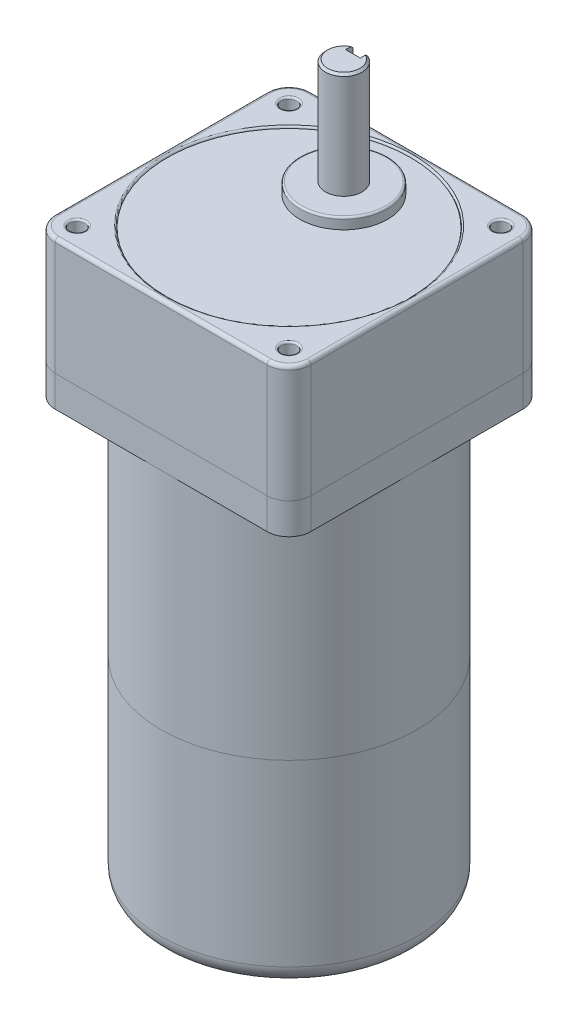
ISO-10303-21;
HEADER;
FILE_DESCRIPTION(('STEP AP214'),'2;1');
FILE_NAME('part.step','',(''),(''),'','','');
FILE_SCHEMA(('AUTOMOTIVE_DESIGN { 1 0 10303 214 1 1 1 1 }'));
ENDSEC;
DATA;
#1=APPLICATION_CONTEXT('core data for automotive mechanical design processes');
#2=APPLICATION_PROTOCOL_DEFINITION('international standard','automotive_design',2000,#1);
#3=PRODUCT_CONTEXT('',#1,'mechanical');
#4=PRODUCT('Part','Part','',(#3));
#5=PRODUCT_RELATED_PRODUCT_CATEGORY('part','',(#4));
#6=PRODUCT_DEFINITION_FORMATION('','',#4);
#7=PRODUCT_DEFINITION_CONTEXT('part definition',#1,'design');
#8=PRODUCT_DEFINITION('design','',#6,#7);
#9=PRODUCT_DEFINITION_SHAPE('','',#8);
#10=(LENGTH_UNIT() NAMED_UNIT(*) SI_UNIT(.MILLI.,.METRE.));
#11=(NAMED_UNIT(*) PLANE_ANGLE_UNIT() SI_UNIT($,.RADIAN.));
#12=(NAMED_UNIT(*) SI_UNIT($,.STERADIAN.) SOLID_ANGLE_UNIT());
#13=UNCERTAINTY_MEASURE_WITH_UNIT(LENGTH_MEASURE(1.E-05),#10,'distance_accuracy_value','');
#14=(GEOMETRIC_REPRESENTATION_CONTEXT(3) GLOBAL_UNCERTAINTY_ASSIGNED_CONTEXT((#13)) GLOBAL_UNIT_ASSIGNED_CONTEXT((#10,
#11,#12)) REPRESENTATION_CONTEXT('',''));
#15=CARTESIAN_POINT('',(0.,0.,0.));
#16=DIRECTION('',(0.,0.,1.));
#17=DIRECTION('',(1.,0.,0.));
#18=AXIS2_PLACEMENT_3D('',#15,#16,#17);
#19=CARTESIAN_POINT('',(0.,32.,-15.));
#20=DIRECTION('',(0.,-1.,0.));
#21=DIRECTION('',(0.,0.,-1.));
#22=AXIS2_PLACEMENT_3D('',#19,#20,#21);
#23=CYLINDRICAL_SURFACE('',#22,5.);
#24=CARTESIAN_POINT('',(0.,3.,-15.));
#25=DIRECTION('',(0.,1.,0.));
#26=DIRECTION('',(0.,0.,1.));
#27=AXIS2_PLACEMENT_3D('',#24,#25,#26);
#28=CIRCLE('',#27,5.);
#29=CARTESIAN_POINT('',(0.,3.,-10.));
#30=VERTEX_POINT('',#29);
#31=EDGE_CURVE('E126',#30,#30,#28,.T.);
#32=ORIENTED_EDGE('',*,*,#31,.T.);
#33=EDGE_LOOP('',(#32));
#34=FACE_BOUND('',#33,.T.);
#35=DIRECTION('',(0.,-1.,0.));
#36=VECTOR('',#35,1.);
#37=CARTESIAN_POINT('',(2.,32.,-19.5825756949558));
#38=LINE('',#37,#36);
#39=CARTESIAN_POINT('',(2.,31.4,-19.5825756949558));
#40=VERTEX_POINT('',#39);
#41=CARTESIAN_POINT('',(2.,9.,-19.5825756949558));
#42=VERTEX_POINT('',#41);
#43=EDGE_CURVE('E115',#40,#42,#38,.T.);
#44=ORIENTED_EDGE('',*,*,#43,.F.);
#45=CARTESIAN_POINT('',(0.,31.4,-15.));
#46=DIRECTION('',(0.,1.,0.));
#47=DIRECTION('',(0.,0.,1.));
#48=AXIS2_PLACEMENT_3D('',#45,#46,#47);
#49=CIRCLE('',#48,5.);
#50=CARTESIAN_POINT('',(-2.,31.4,-19.5825756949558));
#51=VERTEX_POINT('',#50);
#52=EDGE_CURVE('E59',#40,#51,#49,.F.);
#53=ORIENTED_EDGE('',*,*,#52,.T.);
#54=DIRECTION('',(0.,-1.,0.));
#55=VECTOR('',#54,1.);
#56=CARTESIAN_POINT('',(-2.,32.,-19.5825756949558));
#57=LINE('',#56,#55);
#58=CARTESIAN_POINT('',(-2.,9.,-19.5825756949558));
#59=VERTEX_POINT('',#58);
#60=EDGE_CURVE('E117',#59,#51,#57,.F.);
#61=ORIENTED_EDGE('',*,*,#60,.F.);
#62=CARTESIAN_POINT('',(2.,9.,-19.5825756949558));
#63=CARTESIAN_POINT('',(2.00000798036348,8.94619414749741,-19.5825646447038));
#64=CARTESIAN_POINT('',(1.99782891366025,8.89239433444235,-19.5835230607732));
#65=CARTESIAN_POINT('',(1.98915905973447,8.7852287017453,-19.5872962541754));
#66=CARTESIAN_POINT('',(1.98266991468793,8.73186272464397,-19.5901103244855));
#67=CARTESIAN_POINT('',(1.9654760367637,8.62615317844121,-19.5974978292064));
#68=CARTESIAN_POINT('',(1.95478796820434,8.57380641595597,-19.6020643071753));
#69=CARTESIAN_POINT('',(1.92931630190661,8.47029922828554,-19.6128005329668));
#70=CARTESIAN_POINT('',(1.91453245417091,8.41913887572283,-19.618970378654));
#71=CARTESIAN_POINT('',(1.86426971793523,8.26806414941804,-19.6395929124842));
#72=CARTESIAN_POINT('',(1.82284489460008,8.17034576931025,-19.6561744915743));
#73=CARTESIAN_POINT('',(1.72548191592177,7.98320441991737,-19.6931237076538));
#74=CARTESIAN_POINT('',(1.66952996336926,7.89378944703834,-19.7134949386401));
#75=CARTESIAN_POINT('',(1.54131835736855,7.72073760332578,-19.7570099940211));
#76=CARTESIAN_POINT('',(1.4683691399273,7.63763278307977,-19.7802424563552));
#77=CARTESIAN_POINT('',(1.30969646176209,7.48445972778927,-19.8261279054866));
#78=CARTESIAN_POINT('',(1.22397038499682,7.41439416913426,-19.8487807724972));
#79=CARTESIAN_POINT('',(1.03800590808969,7.28659360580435,-19.8920341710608));
#80=CARTESIAN_POINT('',(0.937327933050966,7.22945519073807,-19.9125182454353));
#81=CARTESIAN_POINT('',(0.726824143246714,7.13315592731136,-19.94803944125));
#82=CARTESIAN_POINT('',(0.617002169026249,7.09398757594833,-19.9630788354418));
#83=CARTESIAN_POINT('',(0.396967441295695,7.03665879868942,-19.9853831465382));
#84=CARTESIAN_POINT('',(0.287031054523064,7.01757304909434,-19.9929892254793));
#85=CARTESIAN_POINT('',(0.0652684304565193,6.99797152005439,-20.0008031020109));
#86=CARTESIAN_POINT('',(-0.0465571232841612,6.99744916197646,-20.0010135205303));
#87=CARTESIAN_POINT('',(-0.26223337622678,7.01448283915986,-19.994219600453));
#88=CARTESIAN_POINT('',(-0.366179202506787,7.03102504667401,-19.9876198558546));
#89=CARTESIAN_POINT('',(-0.569674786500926,7.07999342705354,-19.9684927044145));
#90=CARTESIAN_POINT('',(-0.669224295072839,7.11242049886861,-19.9559649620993));
#91=CARTESIAN_POINT('',(-0.862897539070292,7.19263629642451,-19.9259683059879));
#92=CARTESIAN_POINT('',(-0.956916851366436,7.24064924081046,-19.9084277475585));
#93=CARTESIAN_POINT('',(-1.13580746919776,7.35046458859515,-19.8701460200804));
#94=CARTESIAN_POINT('',(-1.22067554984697,7.41227182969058,-19.8494037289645));
#95=CARTESIAN_POINT('',(-1.38476339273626,7.55264418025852,-19.8052178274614));
#96=CARTESIAN_POINT('',(-1.46324770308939,7.63204247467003,-19.7816862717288));
#97=CARTESIAN_POINT('',(-1.60609926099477,7.80298009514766,-19.7356195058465));
#98=CARTESIAN_POINT('',(-1.67046007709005,7.89452492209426,-19.7130847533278));
#99=CARTESIAN_POINT('',(-1.78493657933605,8.09047028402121,-19.6709568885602));
#100=CARTESIAN_POINT('',(-1.83458932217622,8.1951648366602,-19.6514670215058));
#101=CARTESIAN_POINT('',(-1.91521298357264,8.41236152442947,-19.6188610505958));
#102=CARTESIAN_POINT('',(-1.94621696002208,8.52484944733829,-19.6057336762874));
#103=CARTESIAN_POINT('',(-1.9781058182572,8.69874363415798,-19.5920830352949));
#104=CARTESIAN_POINT('',(-1.98630505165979,8.75865754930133,-19.5885343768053));
#105=CARTESIAN_POINT('',(-1.99725282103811,8.87903501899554,-19.5837754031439));
#106=CARTESIAN_POINT('',(-2.00000471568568,8.93949821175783,-19.5825636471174));
#107=CARTESIAN_POINT('',(-2.,9.,-19.5825756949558));
#108=B_SPLINE_CURVE_WITH_KNOTS('',3,(#62,#63,#64,#65,#66,#67,#68,#69,#70,#71,#72,#73,#74,#75,
#76,#77,#78,#79,#80,#81,#82,#83,#84,#85,#86,#87,#88,#89,#90,#91,#92,#93,#94,#95,#96,#97,#98,#99,
#100,#101,#102,#103,#104,#105,#106,#107),.UNSPECIFIED.,.F.,.F.,(4,2,2,2,2,2,2,2,2,2,2,2,2,2,2,2,
2,2,2,2,2,2,4),(0.,0.161354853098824,0.322648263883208,0.483307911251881,0.643977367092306,
0.964683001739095,1.28569434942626,1.62318047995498,1.96073580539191,2.31162858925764,
2.66237473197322,2.9961387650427,3.32978451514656,3.64468915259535,3.95961161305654,
4.27928176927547,4.59906421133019,4.93981874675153,5.28072813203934,5.63144241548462,
5.98153315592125,6.16300192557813,6.3443587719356),.UNSPECIFIED.);
#109=EDGE_CURVE('E129',#42,#59,#108,.T.);
#110=ORIENTED_EDGE('',*,*,#109,.F.);
#111=EDGE_LOOP('',(#44,#53,#61,#110));
#112=FACE_BOUND('',#111,.T.);
#113=ADVANCED_FACE('F46',(#34,#112),#23,.T.);
#114=CARTESIAN_POINT('',(0.,32.,-15.));
#115=DIRECTION('',(0.,1.,0.));
#116=DIRECTION('',(0.,0.,1.));
#117=AXIS2_PLACEMENT_3D('',#114,#115,#116);
#118=PLANE('',#117);
#119=DIRECTION('',(0.,0.,-1.));
#120=VECTOR('',#119,1.);
#121=CARTESIAN_POINT('',(-2.,32.,-17.5));
#122=LINE('',#121,#120);
#123=CARTESIAN_POINT('',(-2.,32.,-17.5));
#124=VERTEX_POINT('',#123);
#125=CARTESIAN_POINT('',(-2.,32.,-18.9191835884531));
#126=VERTEX_POINT('',#125);
#127=EDGE_CURVE('E121',#124,#126,#122,.T.);
#128=ORIENTED_EDGE('',*,*,#127,.T.);
#129=CARTESIAN_POINT('',(0.,32.,-15.));
#130=DIRECTION('',(0.,1.,0.));
#131=DIRECTION('',(0.,0.,1.));
#132=AXIS2_PLACEMENT_3D('',#129,#130,#131);
#133=CIRCLE('',#132,4.40000000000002);
#134=CARTESIAN_POINT('',(2.,32.,-18.9191835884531));
#135=VERTEX_POINT('',#134);
#136=EDGE_CURVE('E135',#126,#135,#133,.T.);
#137=ORIENTED_EDGE('',*,*,#136,.T.);
#138=DIRECTION('',(0.,0.,-1.));
#139=VECTOR('',#138,1.);
#140=CARTESIAN_POINT('',(2.,32.,-17.5));
#141=LINE('',#140,#139);
#142=CARTESIAN_POINT('',(2.,32.,-17.5));
#143=VERTEX_POINT('',#142);
#144=EDGE_CURVE('E118',#143,#135,#141,.T.);
#145=ORIENTED_EDGE('',*,*,#144,.F.);
#146=DIRECTION('',(-1.,0.,0.));
#147=VECTOR('',#146,1.);
#148=CARTESIAN_POINT('',(-2.,32.,-17.5));
#149=LINE('',#148,#147);
#150=EDGE_CURVE('E102',#143,#124,#149,.T.);
#151=ORIENTED_EDGE('',*,*,#150,.T.);
#152=EDGE_LOOP('',(#128,#137,#145,#151));
#153=FACE_BOUND('',#152,.T.);
#154=ADVANCED_FACE('F145',(#153),#118,.T.);
#155=CARTESIAN_POINT('',(0.,3.,-15.));
#156=DIRECTION('',(0.,1.,0.));
#157=DIRECTION('',(0.,0.,1.));
#158=AXIS2_PLACEMENT_3D('',#155,#156,#157);
#159=PLANE('',#158);
#160=ORIENTED_EDGE('',*,*,#31,.F.);
#161=EDGE_LOOP('',(#160));
#162=FACE_BOUND('',#161,.T.);
#163=ADVANCED_FACE('F143',(#162),#159,.F.);
#164=CARTESIAN_POINT('',(0.,9.,-17.5));
#165=DIRECTION('',(0.,0.,-1.));
#166=DIRECTION('',(-1.,0.,0.));
#167=AXIS2_PLACEMENT_3D('',#164,#165,#166);
#168=CYLINDRICAL_SURFACE('',#167,2.);
#169=DIRECTION('',(0.,0.,-1.));
#170=VECTOR('',#169,1.);
#171=CARTESIAN_POINT('',(2.,9.,-17.5));
#172=LINE('',#171,#170);
#173=CARTESIAN_POINT('',(2.,9.,-17.5));
#174=VERTEX_POINT('',#173);
#175=EDGE_CURVE('E110',#174,#42,#172,.T.);
#176=ORIENTED_EDGE('',*,*,#175,.T.);
#177=ORIENTED_EDGE('',*,*,#109,.T.);
#178=DIRECTION('',(0.,0.,-1.));
#179=VECTOR('',#178,1.);
#180=CARTESIAN_POINT('',(-2.,9.,-17.5));
#181=LINE('',#180,#179);
#182=CARTESIAN_POINT('',(-2.,9.,-17.5));
#183=VERTEX_POINT('',#182);
#184=EDGE_CURVE('E112',#183,#59,#181,.T.);
#185=ORIENTED_EDGE('',*,*,#184,.F.);
#186=CARTESIAN_POINT('',(0.,9.,-17.5));
#187=DIRECTION('',(0.,0.,1.));
#188=DIRECTION('',(1.,0.,0.));
#189=AXIS2_PLACEMENT_3D('',#186,#187,#188);
#190=CIRCLE('',#189,2.);
#191=EDGE_CURVE('E100',#183,#174,#190,.T.);
#192=ORIENTED_EDGE('',*,*,#191,.T.);
#193=EDGE_LOOP('',(#176,#177,#185,#192));
#194=FACE_BOUND('',#193,.T.);
#195=ADVANCED_FACE('F109',(#194),#168,.F.);
#196=CARTESIAN_POINT('',(2.,32.,-17.5));
#197=DIRECTION('',(-1.,0.,0.));
#198=DIRECTION('',(0.,0.,1.));
#199=AXIS2_PLACEMENT_3D('',#196,#197,#198);
#200=PLANE('',#199);
#201=ORIENTED_EDGE('',*,*,#144,.T.);
#202=CARTESIAN_POINT('',(2.,32.,-18.9191835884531));
#203=CARTESIAN_POINT('',(2.,31.9504200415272,-18.9748449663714));
#204=CARTESIAN_POINT('',(2.,31.9007196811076,-19.0303989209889));
#205=CARTESIAN_POINT('',(2.,31.8011023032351,-19.1413110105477));
#206=CARTESIAN_POINT('',(2.,31.751185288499,-19.1966691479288));
#207=CARTESIAN_POINT('',(2.,31.6511576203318,-19.3072098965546));
#208=CARTESIAN_POINT('',(2.,31.6010469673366,-19.362392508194));
#209=CARTESIAN_POINT('',(2.,31.5006501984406,-19.4725991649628));
#210=CARTESIAN_POINT('',(2.,31.450364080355,-19.5276232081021));
#211=CARTESIAN_POINT('',(2.,31.4,-19.5825756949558));
#212=B_SPLINE_CURVE_WITH_KNOTS('',3,(#202,#203,#204,#205,#206,#207,#208,#209,#210,#211),
.UNSPECIFIED.,.F.,.F.,(4,2,2,2,4),(0.,0.223622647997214,0.447242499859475,0.670861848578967,
0.894483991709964),.UNSPECIFIED.);
#213=EDGE_CURVE('E73',#135,#40,#212,.T.);
#214=ORIENTED_EDGE('',*,*,#213,.T.);
#215=ORIENTED_EDGE('',*,*,#43,.T.);
#216=ORIENTED_EDGE('',*,*,#175,.F.);
#217=DIRECTION('',(0.,1.,0.));
#218=VECTOR('',#217,1.);
#219=CARTESIAN_POINT('',(2.,32.,-17.5));
#220=LINE('',#219,#218);
#221=EDGE_CURVE('E97',#174,#143,#220,.T.);
#222=ORIENTED_EDGE('',*,*,#221,.T.);
#223=EDGE_LOOP('',(#201,#214,#215,#216,#222));
#224=FACE_BOUND('',#223,.T.);
#225=ADVANCED_FACE('F114',(#224),#200,.T.);
#226=CARTESIAN_POINT('',(-2.,9.,-17.5));
#227=DIRECTION('',(1.,0.,0.));
#228=DIRECTION('',(0.,0.,-1.));
#229=AXIS2_PLACEMENT_3D('',#226,#227,#228);
#230=PLANE('',#229);
#231=ORIENTED_EDGE('',*,*,#60,.T.);
#232=CARTESIAN_POINT('',(-2.,31.4,-19.5825756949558));
#233=CARTESIAN_POINT('',(-2.,31.450364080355,-19.5276232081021));
#234=CARTESIAN_POINT('',(-2.,31.5006501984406,-19.4725991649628));
#235=CARTESIAN_POINT('',(-2.,31.6010469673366,-19.362392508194));
#236=CARTESIAN_POINT('',(-2.,31.6511576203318,-19.3072098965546));
#237=CARTESIAN_POINT('',(-2.,31.751185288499,-19.1966691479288));
#238=CARTESIAN_POINT('',(-2.,31.8011023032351,-19.1413110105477));
#239=CARTESIAN_POINT('',(-2.,31.9007196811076,-19.0303989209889));
#240=CARTESIAN_POINT('',(-2.,31.9504200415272,-18.9748449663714));
#241=CARTESIAN_POINT('',(-2.,32.,-18.9191835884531));
#242=B_SPLINE_CURVE_WITH_KNOTS('',3,(#232,#233,#234,#235,#236,#237,#238,#239,#240,#241),
.UNSPECIFIED.,.F.,.F.,(4,2,2,2,4),(0.,0.223622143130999,0.447241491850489,0.670861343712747,
0.894483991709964),.UNSPECIFIED.);
#243=EDGE_CURVE('E12',#51,#126,#242,.T.);
#244=ORIENTED_EDGE('',*,*,#243,.T.);
#245=ORIENTED_EDGE('',*,*,#127,.F.);
#246=DIRECTION('',(0.,-1.,0.));
#247=VECTOR('',#246,1.);
#248=CARTESIAN_POINT('',(-2.,9.,-17.5));
#249=LINE('',#248,#247);
#250=EDGE_CURVE('E167',#124,#183,#249,.T.);
#251=ORIENTED_EDGE('',*,*,#250,.T.);
#252=ORIENTED_EDGE('',*,*,#184,.T.);
#253=EDGE_LOOP('',(#231,#244,#245,#251,#252));
#254=FACE_BOUND('',#253,.T.);
#255=ADVANCED_FACE('F171',(#254),#230,.T.);
#256=CARTESIAN_POINT('',(0.,9.,-17.5));
#257=DIRECTION('',(0.,0.,1.));
#258=DIRECTION('',(1.,0.,0.));
#259=AXIS2_PLACEMENT_3D('',#256,#257,#258);
#260=PLANE('',#259);
#261=ORIENTED_EDGE('',*,*,#191,.F.);
#262=ORIENTED_EDGE('',*,*,#250,.F.);
#263=ORIENTED_EDGE('',*,*,#150,.F.);
#264=ORIENTED_EDGE('',*,*,#221,.F.);
#265=EDGE_LOOP('',(#261,#262,#263,#264));
#266=FACE_BOUND('',#265,.T.);
#267=ADVANCED_FACE('F99',(#266),#260,.F.);
#268=CARTESIAN_POINT('',(0.,32.,-15.));
#269=DIRECTION('',(0.,-1.,0.));
#270=DIRECTION('',(0.,0.,-1.));
#271=AXIS2_PLACEMENT_3D('',#268,#269,#270);
#272=CONICAL_SURFACE('',#271,4.40000000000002,0.78539816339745);
#273=ORIENTED_EDGE('',*,*,#243,.F.);
#274=ORIENTED_EDGE('',*,*,#52,.F.);
#275=ORIENTED_EDGE('',*,*,#213,.F.);
#276=ORIENTED_EDGE('',*,*,#136,.F.);
#277=EDGE_LOOP('',(#273,#274,#275,#276));
#278=FACE_BOUND('',#277,.T.);
#279=ADVANCED_FACE('F48',(#278),#272,.T.);
#280=CLOSED_SHELL('',(#113,#154,#163,#195,#225,#255,#267,#279));
#281=MANIFOLD_SOLID_BREP('B2',#280);
#282=CARTESIAN_POINT('',(0.,3.,-15.));
#283=DIRECTION('',(0.,-1.,0.));
#284=DIRECTION('',(0.,0.,-1.));
#285=AXIS2_PLACEMENT_3D('',#282,#283,#284);
#286=CYLINDRICAL_SURFACE('',#285,12.);
#287=CARTESIAN_POINT('',(0.,2.5,-15.));
#288=DIRECTION('',(0.,1.,0.));
#289=DIRECTION('',(0.,0.,1.));
#290=AXIS2_PLACEMENT_3D('',#287,#288,#289);
#291=CIRCLE('',#290,12.);
#292=CARTESIAN_POINT('',(0.,2.5,-3.));
#293=VERTEX_POINT('',#292);
#294=EDGE_CURVE('E45',#293,#293,#291,.F.);
#295=ORIENTED_EDGE('',*,*,#294,.T.);
#296=EDGE_LOOP('',(#295));
#297=FACE_BOUND('',#296,.T.);
#298=CARTESIAN_POINT('',(0.,0.,-15.));
#299=DIRECTION('',(0.,1.,0.));
#300=DIRECTION('',(0.,0.,1.));
#301=AXIS2_PLACEMENT_3D('',#298,#299,#300);
#302=CIRCLE('',#301,12.);
#303=CARTESIAN_POINT('',(0.,0.,-3.));
#304=VERTEX_POINT('',#303);
#305=EDGE_CURVE('E245',#304,#304,#302,.T.);
#306=ORIENTED_EDGE('',*,*,#305,.T.);
#307=EDGE_LOOP('',(#306));
#308=FACE_BOUND('',#307,.T.);
#309=ADVANCED_FACE('F234',(#297,#308),#286,.T.);
#310=CARTESIAN_POINT('',(0.,3.,-15.));
#311=DIRECTION('',(0.,1.,0.));
#312=DIRECTION('',(0.,0.,1.));
#313=AXIS2_PLACEMENT_3D('',#310,#311,#312);
#314=PLANE('',#313);
#315=CARTESIAN_POINT('',(0.,3.,-15.));
#316=DIRECTION('',(0.,1.,0.));
#317=DIRECTION('',(0.,0.,1.));
#318=AXIS2_PLACEMENT_3D('',#315,#316,#317);
#319=CIRCLE('',#318,11.5);
#320=CARTESIAN_POINT('',(0.,3.,-3.5));
#321=VERTEX_POINT('',#320);
#322=EDGE_CURVE('E241',#321,#321,#319,.T.);
#323=ORIENTED_EDGE('',*,*,#322,.T.);
#324=EDGE_LOOP('',(#323));
#325=FACE_BOUND('',#324,.T.);
#326=ADVANCED_FACE('F255',(#325),#314,.T.);
#327=CARTESIAN_POINT('',(0.,0.,-15.));
#328=DIRECTION('',(0.,1.,0.));
#329=DIRECTION('',(0.,0.,1.));
#330=AXIS2_PLACEMENT_3D('',#327,#328,#329);
#331=PLANE('',#330);
#332=ORIENTED_EDGE('',*,*,#305,.F.);
#333=EDGE_LOOP('',(#332));
#334=FACE_BOUND('',#333,.T.);
#335=ADVANCED_FACE('F253',(#334),#331,.F.);
#336=CARTESIAN_POINT('',(0.,2.5,-15.));
#337=DIRECTION('',(0.,1.,0.));
#338=DIRECTION('',(0.,0.,1.));
#339=AXIS2_PLACEMENT_3D('',#336,#337,#338);
#340=TOROIDAL_SURFACE('',#339,11.5,0.5);
#341=ORIENTED_EDGE('',*,*,#294,.F.);
#342=EDGE_LOOP('',(#341));
#343=FACE_BOUND('',#342,.T.);
#344=ORIENTED_EDGE('',*,*,#322,.F.);
#345=EDGE_LOOP('',(#344));
#346=FACE_BOUND('',#345,.T.);
#347=ADVANCED_FACE('F236',(#343,#346),#340,.T.);
#348=CLOSED_SHELL('',(#309,#326,#335,#347));
#349=MANIFOLD_SOLID_BREP('B6',#348);
#350=CARTESIAN_POINT('',(0.,-156.,0.));
#351=DIRECTION('',(0.,1.,0.));
#352=DIRECTION('',(0.,0.,1.));
#353=AXIS2_PLACEMENT_3D('',#350,#351,#352);
#354=CYLINDRICAL_SURFACE('',#353,35.);
#355=CARTESIAN_POINT('',(0.,-151.,0.));
#356=DIRECTION('',(0.,-1.,0.));
#357=DIRECTION('',(0.,0.,-1.));
#358=AXIS2_PLACEMENT_3D('',#355,#356,#357);
#359=CIRCLE('',#358,35.);
#360=CARTESIAN_POINT('',(0.,-151.,-35.));
#361=VERTEX_POINT('',#360);
#362=EDGE_CURVE('E233',#361,#361,#359,.F.);
#363=ORIENTED_EDGE('',*,*,#362,.T.);
#364=EDGE_LOOP('',(#363));
#365=FACE_BOUND('',#364,.T.);
#366=CARTESIAN_POINT('',(0.,-102.,0.));
#367=DIRECTION('',(0.,-1.,0.));
#368=DIRECTION('',(0.,0.,-1.));
#369=AXIS2_PLACEMENT_3D('',#366,#367,#368);
#370=CIRCLE('',#369,35.);
#371=CARTESIAN_POINT('',(0.,-102.,-35.));
#372=VERTEX_POINT('',#371);
#373=EDGE_CURVE('E309',#372,#372,#370,.T.);
#374=ORIENTED_EDGE('',*,*,#373,.T.);
#375=EDGE_LOOP('',(#374));
#376=FACE_BOUND('',#375,.T.);
#377=ADVANCED_FACE('F298',(#365,#376),#354,.T.);
#378=CARTESIAN_POINT('',(0.,-156.,0.));
#379=DIRECTION('',(0.,-1.,0.));
#380=DIRECTION('',(0.,0.,-1.));
#381=AXIS2_PLACEMENT_3D('',#378,#379,#380);
#382=PLANE('',#381);
#383=CARTESIAN_POINT('',(0.,-156.,0.));
#384=DIRECTION('',(0.,-1.,0.));
#385=DIRECTION('',(0.,0.,-1.));
#386=AXIS2_PLACEMENT_3D('',#383,#384,#385);
#387=CIRCLE('',#386,30.);
#388=CARTESIAN_POINT('',(0.,-156.,-30.));
#389=VERTEX_POINT('',#388);
#390=EDGE_CURVE('E305',#389,#389,#387,.T.);
#391=ORIENTED_EDGE('',*,*,#390,.T.);
#392=EDGE_LOOP('',(#391));
#393=FACE_BOUND('',#392,.T.);
#394=ADVANCED_FACE('F319',(#393),#382,.T.);
#395=CARTESIAN_POINT('',(0.,-102.,0.));
#396=DIRECTION('',(0.,-1.,0.));
#397=DIRECTION('',(0.,0.,-1.));
#398=AXIS2_PLACEMENT_3D('',#395,#396,#397);
#399=PLANE('',#398);
#400=ORIENTED_EDGE('',*,*,#373,.F.);
#401=EDGE_LOOP('',(#400));
#402=FACE_BOUND('',#401,.T.);
#403=ADVANCED_FACE('F317',(#402),#399,.F.);
#404=CARTESIAN_POINT('',(0.,-151.,0.));
#405=DIRECTION('',(0.,-1.,0.));
#406=DIRECTION('',(0.,0.,-1.));
#407=AXIS2_PLACEMENT_3D('',#404,#405,#406);
#408=TOROIDAL_SURFACE('',#407,30.,5.);
#409=ORIENTED_EDGE('',*,*,#362,.F.);
#410=EDGE_LOOP('',(#409));
#411=FACE_BOUND('',#410,.T.);
#412=ORIENTED_EDGE('',*,*,#390,.F.);
#413=EDGE_LOOP('',(#412));
#414=FACE_BOUND('',#413,.T.);
#415=ADVANCED_FACE('F300',(#411,#414),#408,.T.);
#416=CLOSED_SHELL('',(#377,#394,#403,#415));
#417=MANIFOLD_SOLID_BREP('B40',#416);
#418=CARTESIAN_POINT('',(0.,-102.,0.));
#419=DIRECTION('',(0.,1.,0.));
#420=DIRECTION('',(0.,0.,1.));
#421=AXIS2_PLACEMENT_3D('',#418,#419,#420);
#422=CYLINDRICAL_SURFACE('',#421,35.);
#423=CARTESIAN_POINT('',(0.,-102.,0.));
#424=DIRECTION('',(0.,-1.,0.));
#425=DIRECTION('',(0.,0.,-1.));
#426=AXIS2_PLACEMENT_3D('',#423,#424,#425);
#427=CIRCLE('',#426,35.);
#428=CARTESIAN_POINT('',(0.,-102.,-35.));
#429=VERTEX_POINT('',#428);
#430=EDGE_CURVE('E297',#429,#429,#427,.T.);
#431=ORIENTED_EDGE('',*,*,#430,.F.);
#432=EDGE_LOOP('',(#431));
#433=FACE_BOUND('',#432,.T.);
#434=CARTESIAN_POINT('',(0.,-40.5,0.));
#435=DIRECTION('',(0.,-1.,0.));
#436=DIRECTION('',(0.,0.,-1.));
#437=AXIS2_PLACEMENT_3D('',#434,#435,#436);
#438=CIRCLE('',#437,35.);
#439=CARTESIAN_POINT('',(0.,-40.5,-35.));
#440=VERTEX_POINT('',#439);
#441=EDGE_CURVE('E367',#440,#440,#438,.T.);
#442=ORIENTED_EDGE('',*,*,#441,.T.);
#443=EDGE_LOOP('',(#442));
#444=FACE_BOUND('',#443,.T.);
#445=ADVANCED_FACE('F364',(#433,#444),#422,.T.);
#446=CARTESIAN_POINT('',(0.,-102.,0.));
#447=DIRECTION('',(0.,-1.,0.));
#448=DIRECTION('',(0.,0.,-1.));
#449=AXIS2_PLACEMENT_3D('',#446,#447,#448);
#450=PLANE('',#449);
#451=ORIENTED_EDGE('',*,*,#430,.T.);
#452=EDGE_LOOP('',(#451));
#453=FACE_BOUND('',#452,.T.);
#454=ADVANCED_FACE('F379',(#453),#450,.T.);
#455=CARTESIAN_POINT('',(0.,-40.5,0.));
#456=DIRECTION('',(0.,-1.,0.));
#457=DIRECTION('',(0.,0.,-1.));
#458=AXIS2_PLACEMENT_3D('',#455,#456,#457);
#459=PLANE('',#458);
#460=ORIENTED_EDGE('',*,*,#441,.F.);
#461=EDGE_LOOP('',(#460));
#462=FACE_BOUND('',#461,.T.);
#463=ADVANCED_FACE('F377',(#462),#459,.F.);
#464=CLOSED_SHELL('',(#445,#454,#463));
#465=MANIFOLD_SOLID_BREP('B228',#464);
#466=CARTESIAN_POINT('',(-29.,-40.5,-29.));
#467=DIRECTION('',(0.,1.,0.));
#468=DIRECTION('',(0.,0.,1.));
#469=AXIS2_PLACEMENT_3D('',#466,#467,#468);
#470=CYLINDRICAL_SURFACE('',#469,6.);
#471=CARTESIAN_POINT('',(-29.,-32.,-29.));
#472=DIRECTION('',(0.,-1.,0.));
#473=DIRECTION('',(0.,0.,1.));
#474=AXIS2_PLACEMENT_3D('',#471,#472,#473);
#475=CIRCLE('',#474,6.);
#476=CARTESIAN_POINT('',(-35.,-32.,-29.));
#477=VERTEX_POINT('',#476);
#478=CARTESIAN_POINT('',(-29.,-32.,-35.));
#479=VERTEX_POINT('',#478);
#480=EDGE_CURVE('E512',#477,#479,#475,.T.);
#481=ORIENTED_EDGE('',*,*,#480,.T.);
#482=DIRECTION('',(0.,1.,0.));
#483=VECTOR('',#482,1.);
#484=CARTESIAN_POINT('',(-29.,-40.5,-35.));
#485=LINE('',#484,#483);
#486=CARTESIAN_POINT('',(-29.,-40.5,-35.));
#487=VERTEX_POINT('',#486);
#488=EDGE_CURVE('E362',#487,#479,#485,.T.);
#489=ORIENTED_EDGE('',*,*,#488,.F.);
#490=CARTESIAN_POINT('',(-29.,-40.5,-29.));
#491=DIRECTION('',(0.,-1.,0.));
#492=DIRECTION('',(0.,0.,1.));
#493=AXIS2_PLACEMENT_3D('',#490,#491,#492);
#494=CIRCLE('',#493,6.);
#495=CARTESIAN_POINT('',(-35.,-40.5,-29.));
#496=VERTEX_POINT('',#495);
#497=EDGE_CURVE('E526',#496,#487,#494,.T.);
#498=ORIENTED_EDGE('',*,*,#497,.F.);
#499=DIRECTION('',(0.,1.,0.));
#500=VECTOR('',#499,1.);
#501=CARTESIAN_POINT('',(-35.,-40.5,-29.));
#502=LINE('',#501,#500);
#503=EDGE_CURVE('E508',#496,#477,#502,.T.);
#504=ORIENTED_EDGE('',*,*,#503,.T.);
#505=EDGE_LOOP('',(#481,#489,#498,#504));
#506=FACE_BOUND('',#505,.T.);
#507=ADVANCED_FACE('F414',(#506),#470,.T.);
#508=CARTESIAN_POINT('',(-29.,-40.5,-35.));
#509=DIRECTION('',(0.,0.,1.));
#510=DIRECTION('',(1.,0.,0.));
#511=AXIS2_PLACEMENT_3D('',#508,#509,#510);
#512=PLANE('',#511);
#513=DIRECTION('',(1.,0.,0.));
#514=VECTOR('',#513,1.);
#515=CARTESIAN_POINT('',(-29.,-32.,-35.));
#516=LINE('',#515,#514);
#517=CARTESIAN_POINT('',(29.,-32.,-35.));
#518=VERTEX_POINT('',#517);
#519=EDGE_CURVE('E515',#479,#518,#516,.T.);
#520=ORIENTED_EDGE('',*,*,#519,.T.);
#521=DIRECTION('',(0.,1.,0.));
#522=VECTOR('',#521,1.);
#523=CARTESIAN_POINT('',(29.,-40.5,-35.));
#524=LINE('',#523,#522);
#525=CARTESIAN_POINT('',(29.,-40.5,-35.));
#526=VERTEX_POINT('',#525);
#527=EDGE_CURVE('E423',#526,#518,#524,.T.);
#528=ORIENTED_EDGE('',*,*,#527,.F.);
#529=DIRECTION('',(1.,0.,0.));
#530=VECTOR('',#529,1.);
#531=CARTESIAN_POINT('',(-29.,-40.5,-35.));
#532=LINE('',#531,#530);
#533=EDGE_CURVE('E475',#487,#526,#532,.T.);
#534=ORIENTED_EDGE('',*,*,#533,.F.);
#535=ORIENTED_EDGE('',*,*,#488,.T.);
#536=EDGE_LOOP('',(#520,#528,#534,#535));
#537=FACE_BOUND('',#536,.T.);
#538=ADVANCED_FACE('F580',(#537),#512,.F.);
#539=CARTESIAN_POINT('',(29.,-40.5,-29.));
#540=DIRECTION('',(0.,1.,0.));
#541=DIRECTION('',(0.,0.,1.));
#542=AXIS2_PLACEMENT_3D('',#539,#540,#541);
#543=CYLINDRICAL_SURFACE('',#542,6.);
#544=CARTESIAN_POINT('',(29.,-32.,-29.));
#545=DIRECTION('',(0.,-1.,0.));
#546=DIRECTION('',(0.,0.,-1.));
#547=AXIS2_PLACEMENT_3D('',#544,#545,#546);
#548=CIRCLE('',#547,6.);
#549=CARTESIAN_POINT('',(35.,-32.,-29.));
#550=VERTEX_POINT('',#549);
#551=EDGE_CURVE('E517',#518,#550,#548,.T.);
#552=ORIENTED_EDGE('',*,*,#551,.T.);
#553=DIRECTION('',(0.,1.,0.));
#554=VECTOR('',#553,1.);
#555=CARTESIAN_POINT('',(35.,-40.5,-29.));
#556=LINE('',#555,#554);
#557=CARTESIAN_POINT('',(35.,-40.5,-29.));
#558=VERTEX_POINT('',#557);
#559=EDGE_CURVE('E533',#558,#550,#556,.T.);
#560=ORIENTED_EDGE('',*,*,#559,.F.);
#561=CARTESIAN_POINT('',(29.,-40.5,-29.));
#562=DIRECTION('',(0.,-1.,0.));
#563=DIRECTION('',(0.,0.,-1.));
#564=AXIS2_PLACEMENT_3D('',#561,#562,#563);
#565=CIRCLE('',#564,6.);
#566=EDGE_CURVE('E681',#526,#558,#565,.T.);
#567=ORIENTED_EDGE('',*,*,#566,.F.);
#568=ORIENTED_EDGE('',*,*,#527,.T.);
#569=EDGE_LOOP('',(#552,#560,#567,#568));
#570=FACE_BOUND('',#569,.T.);
#571=ADVANCED_FACE('F584',(#570),#543,.T.);
#572=CARTESIAN_POINT('',(35.,-40.5,-29.));
#573=DIRECTION('',(-1.,0.,0.));
#574=DIRECTION('',(0.,0.,1.));
#575=AXIS2_PLACEMENT_3D('',#572,#573,#574);
#576=PLANE('',#575);
#577=DIRECTION('',(0.,0.,1.));
#578=VECTOR('',#577,1.);
#579=CARTESIAN_POINT('',(35.,-32.,-29.));
#580=LINE('',#579,#578);
#581=CARTESIAN_POINT('',(35.,-32.,29.));
#582=VERTEX_POINT('',#581);
#583=EDGE_CURVE('E519',#550,#582,#580,.T.);
#584=ORIENTED_EDGE('',*,*,#583,.T.);
#585=DIRECTION('',(0.,1.,0.));
#586=VECTOR('',#585,1.);
#587=CARTESIAN_POINT('',(35.,-40.5,29.));
#588=LINE('',#587,#586);
#589=CARTESIAN_POINT('',(35.,-40.5,29.));
#590=VERTEX_POINT('',#589);
#591=EDGE_CURVE('E530',#590,#582,#588,.T.);
#592=ORIENTED_EDGE('',*,*,#591,.F.);
#593=DIRECTION('',(0.,0.,1.));
#594=VECTOR('',#593,1.);
#595=CARTESIAN_POINT('',(35.,-40.5,-29.));
#596=LINE('',#595,#594);
#597=EDGE_CURVE('E683',#558,#590,#596,.T.);
#598=ORIENTED_EDGE('',*,*,#597,.F.);
#599=ORIENTED_EDGE('',*,*,#559,.T.);
#600=EDGE_LOOP('',(#584,#592,#598,#599));
#601=FACE_BOUND('',#600,.T.);
#602=ADVANCED_FACE('F588',(#601),#576,.F.);
#603=CARTESIAN_POINT('',(29.,-40.5,29.));
#604=DIRECTION('',(0.,1.,0.));
#605=DIRECTION('',(0.,0.,1.));
#606=AXIS2_PLACEMENT_3D('',#603,#604,#605);
#607=CYLINDRICAL_SURFACE('',#606,6.);
#608=CARTESIAN_POINT('',(29.,-32.,29.));
#609=DIRECTION('',(0.,-1.,0.));
#610=DIRECTION('',(0.,0.,1.));
#611=AXIS2_PLACEMENT_3D('',#608,#609,#610);
#612=CIRCLE('',#611,6.);
#613=CARTESIAN_POINT('',(29.,-32.,35.));
#614=VERTEX_POINT('',#613);
#615=EDGE_CURVE('E521',#582,#614,#612,.T.);
#616=ORIENTED_EDGE('',*,*,#615,.T.);
#617=DIRECTION('',(0.,1.,0.));
#618=VECTOR('',#617,1.);
#619=CARTESIAN_POINT('',(29.,-40.5,35.));
#620=LINE('',#619,#618);
#621=CARTESIAN_POINT('',(29.,-40.5,35.));
#622=VERTEX_POINT('',#621);
#623=EDGE_CURVE('E503',#622,#614,#620,.T.);
#624=ORIENTED_EDGE('',*,*,#623,.F.);
#625=CARTESIAN_POINT('',(29.,-40.5,29.));
#626=DIRECTION('',(0.,-1.,0.));
#627=DIRECTION('',(0.,0.,1.));
#628=AXIS2_PLACEMENT_3D('',#625,#626,#627);
#629=CIRCLE('',#628,6.);
#630=EDGE_CURVE('E494',#590,#622,#629,.T.);
#631=ORIENTED_EDGE('',*,*,#630,.F.);
#632=ORIENTED_EDGE('',*,*,#591,.T.);
#633=EDGE_LOOP('',(#616,#624,#631,#632));
#634=FACE_BOUND('',#633,.T.);
#635=ADVANCED_FACE('F594',(#634),#607,.T.);
#636=CARTESIAN_POINT('',(-29.,-40.5,35.));
#637=DIRECTION('',(0.,0.,-1.));
#638=DIRECTION('',(-1.,0.,0.));
#639=AXIS2_PLACEMENT_3D('',#636,#637,#638);
#640=PLANE('',#639);
#641=DIRECTION('',(-1.,0.,0.));
#642=VECTOR('',#641,1.);
#643=CARTESIAN_POINT('',(-29.,-32.,35.));
#644=LINE('',#643,#642);
#645=CARTESIAN_POINT('',(-29.,-32.,35.));
#646=VERTEX_POINT('',#645);
#647=EDGE_CURVE('E502',#614,#646,#644,.T.);
#648=ORIENTED_EDGE('',*,*,#647,.T.);
#649=DIRECTION('',(0.,1.,0.));
#650=VECTOR('',#649,1.);
#651=CARTESIAN_POINT('',(-29.,-40.5,35.));
#652=LINE('',#651,#650);
#653=CARTESIAN_POINT('',(-29.,-40.5,35.));
#654=VERTEX_POINT('',#653);
#655=EDGE_CURVE('E499',#654,#646,#652,.T.);
#656=ORIENTED_EDGE('',*,*,#655,.F.);
#657=DIRECTION('',(-1.,0.,0.));
#658=VECTOR('',#657,1.);
#659=CARTESIAN_POINT('',(-29.,-40.5,35.));
#660=LINE('',#659,#658);
#661=EDGE_CURVE('E488',#622,#654,#660,.T.);
#662=ORIENTED_EDGE('',*,*,#661,.F.);
#663=ORIENTED_EDGE('',*,*,#623,.T.);
#664=EDGE_LOOP('',(#648,#656,#662,#663));
#665=FACE_BOUND('',#664,.T.);
#666=ADVANCED_FACE('F500',(#665),#640,.F.);
#667=CARTESIAN_POINT('',(-29.,-40.5,29.));
#668=DIRECTION('',(0.,1.,0.));
#669=DIRECTION('',(0.,0.,1.));
#670=AXIS2_PLACEMENT_3D('',#667,#668,#669);
#671=CYLINDRICAL_SURFACE('',#670,6.);
#672=CARTESIAN_POINT('',(-29.,-32.,29.));
#673=DIRECTION('',(0.,-1.,0.));
#674=DIRECTION('',(0.,0.,1.));
#675=AXIS2_PLACEMENT_3D('',#672,#673,#674);
#676=CIRCLE('',#675,6.);
#677=CARTESIAN_POINT('',(-35.,-32.,29.));
#678=VERTEX_POINT('',#677);
#679=EDGE_CURVE('E461',#646,#678,#676,.T.);
#680=ORIENTED_EDGE('',*,*,#679,.T.);
#681=DIRECTION('',(0.,1.,0.));
#682=VECTOR('',#681,1.);
#683=CARTESIAN_POINT('',(-35.,-40.5,29.));
#684=LINE('',#683,#682);
#685=CARTESIAN_POINT('',(-35.,-40.5,29.));
#686=VERTEX_POINT('',#685);
#687=EDGE_CURVE('E504',#686,#678,#684,.T.);
#688=ORIENTED_EDGE('',*,*,#687,.F.);
#689=CARTESIAN_POINT('',(-29.,-40.5,29.));
#690=DIRECTION('',(0.,-1.,0.));
#691=DIRECTION('',(0.,0.,1.));
#692=AXIS2_PLACEMENT_3D('',#689,#690,#691);
#693=CIRCLE('',#692,6.);
#694=EDGE_CURVE('E492',#654,#686,#693,.T.);
#695=ORIENTED_EDGE('',*,*,#694,.F.);
#696=ORIENTED_EDGE('',*,*,#655,.T.);
#697=EDGE_LOOP('',(#680,#688,#695,#696));
#698=FACE_BOUND('',#697,.T.);
#699=ADVANCED_FACE('F506',(#698),#671,.T.);
#700=CARTESIAN_POINT('',(-35.,-40.5,-29.));
#701=DIRECTION('',(1.,0.,0.));
#702=DIRECTION('',(0.,0.,-1.));
#703=AXIS2_PLACEMENT_3D('',#700,#701,#702);
#704=PLANE('',#703);
#705=DIRECTION('',(0.,0.,-1.));
#706=VECTOR('',#705,1.);
#707=CARTESIAN_POINT('',(-35.,-32.,-29.));
#708=LINE('',#707,#706);
#709=EDGE_CURVE('E467',#678,#477,#708,.T.);
#710=ORIENTED_EDGE('',*,*,#709,.T.);
#711=ORIENTED_EDGE('',*,*,#503,.F.);
#712=DIRECTION('',(0.,0.,-1.));
#713=VECTOR('',#712,1.);
#714=CARTESIAN_POINT('',(-35.,-40.5,-29.));
#715=LINE('',#714,#713);
#716=EDGE_CURVE('E432',#686,#496,#715,.T.);
#717=ORIENTED_EDGE('',*,*,#716,.F.);
#718=ORIENTED_EDGE('',*,*,#687,.T.);
#719=EDGE_LOOP('',(#710,#711,#717,#718));
#720=FACE_BOUND('',#719,.T.);
#721=ADVANCED_FACE('F569',(#720),#704,.F.);
#722=CARTESIAN_POINT('',(-29.,-40.5,-29.));
#723=DIRECTION('',(0.,1.,0.));
#724=DIRECTION('',(0.,0.,1.));
#725=AXIS2_PLACEMENT_3D('',#722,#723,#724);
#726=PLANE('',#725);
#727=CARTESIAN_POINT('',(-28.9913780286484,-40.5,28.9913780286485));
#728=DIRECTION('',(0.,-1.,0.));
#729=DIRECTION('',(0.,0.,-1.));
#730=AXIS2_PLACEMENT_3D('',#727,#728,#729);
#731=CIRCLE('',#730,3.);
#732=CARTESIAN_POINT('',(-28.9913780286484,-40.5,25.9913780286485));
#733=VERTEX_POINT('',#732);
#734=EDGE_CURVE('E542',#733,#733,#731,.T.);
#735=ORIENTED_EDGE('',*,*,#734,.F.);
#736=EDGE_LOOP('',(#735));
#737=FACE_BOUND('',#736,.T.);
#738=CARTESIAN_POINT('',(28.9913780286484,-40.5,28.9913780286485));
#739=DIRECTION('',(0.,-1.,0.));
#740=DIRECTION('',(0.,0.,-1.));
#741=AXIS2_PLACEMENT_3D('',#738,#739,#740);
#742=CIRCLE('',#741,3.);
#743=CARTESIAN_POINT('',(28.9913780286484,-40.5,25.9913780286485));
#744=VERTEX_POINT('',#743);
#745=EDGE_CURVE('E667',#744,#744,#742,.T.);
#746=ORIENTED_EDGE('',*,*,#745,.F.);
#747=EDGE_LOOP('',(#746));
#748=FACE_BOUND('',#747,.T.);
#749=CARTESIAN_POINT('',(28.9913780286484,-40.5,-28.9913780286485));
#750=DIRECTION('',(0.,-1.,0.));
#751=DIRECTION('',(0.,0.,-1.));
#752=AXIS2_PLACEMENT_3D('',#749,#750,#751);
#753=CIRCLE('',#752,3.);
#754=CARTESIAN_POINT('',(28.9913780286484,-40.5,-31.9913780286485));
#755=VERTEX_POINT('',#754);
#756=EDGE_CURVE('E669',#755,#755,#753,.T.);
#757=ORIENTED_EDGE('',*,*,#756,.F.);
#758=EDGE_LOOP('',(#757));
#759=FACE_BOUND('',#758,.T.);
#760=CARTESIAN_POINT('',(-28.9913780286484,-40.5,-28.9913780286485));
#761=DIRECTION('',(0.,-1.,0.));
#762=DIRECTION('',(0.,0.,-1.));
#763=AXIS2_PLACEMENT_3D('',#760,#761,#762);
#764=CIRCLE('',#763,3.);
#765=CARTESIAN_POINT('',(-28.9913780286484,-40.5,-31.9913780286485));
#766=VERTEX_POINT('',#765);
#767=EDGE_CURVE('E674',#766,#766,#764,.T.);
#768=ORIENTED_EDGE('',*,*,#767,.F.);
#769=EDGE_LOOP('',(#768));
#770=FACE_BOUND('',#769,.T.);
#771=ORIENTED_EDGE('',*,*,#497,.T.);
#772=ORIENTED_EDGE('',*,*,#533,.T.);
#773=ORIENTED_EDGE('',*,*,#566,.T.);
#774=ORIENTED_EDGE('',*,*,#597,.T.);
#775=ORIENTED_EDGE('',*,*,#630,.T.);
#776=ORIENTED_EDGE('',*,*,#661,.T.);
#777=ORIENTED_EDGE('',*,*,#694,.T.);
#778=ORIENTED_EDGE('',*,*,#716,.T.);
#779=EDGE_LOOP('',(#771,#772,#773,#774,#775,#776,#777,#778));
#780=FACE_BOUND('',#779,.T.);
#781=ADVANCED_FACE('F490',(#737,#748,#759,#770,#780),#726,.F.);
#782=CARTESIAN_POINT('',(-29.,-32.,-29.));
#783=DIRECTION('',(0.,1.,0.));
#784=DIRECTION('',(0.,0.,1.));
#785=AXIS2_PLACEMENT_3D('',#782,#783,#784);
#786=PLANE('',#785);
#787=CARTESIAN_POINT('',(-28.9913780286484,-32.,28.9913780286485));
#788=DIRECTION('',(0.,1.,0.));
#789=DIRECTION('',(0.,0.,1.));
#790=AXIS2_PLACEMENT_3D('',#787,#788,#789);
#791=CIRCLE('',#790,3.);
#792=CARTESIAN_POINT('',(-28.9913780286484,-32.,31.9913780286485));
#793=VERTEX_POINT('',#792);
#794=EDGE_CURVE('E417',#793,#793,#791,.T.);
#795=ORIENTED_EDGE('',*,*,#794,.F.);
#796=EDGE_LOOP('',(#795));
#797=FACE_BOUND('',#796,.T.);
#798=CARTESIAN_POINT('',(28.9913780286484,-32.,28.9913780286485));
#799=DIRECTION('',(0.,1.,0.));
#800=DIRECTION('',(0.,0.,1.));
#801=AXIS2_PLACEMENT_3D('',#798,#799,#800);
#802=CIRCLE('',#801,3.);
#803=CARTESIAN_POINT('',(28.9913780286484,-32.,31.9913780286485));
#804=VERTEX_POINT('',#803);
#805=EDGE_CURVE('E544',#804,#804,#802,.T.);
#806=ORIENTED_EDGE('',*,*,#805,.F.);
#807=EDGE_LOOP('',(#806));
#808=FACE_BOUND('',#807,.T.);
#809=CARTESIAN_POINT('',(28.9913780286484,-32.,-28.9913780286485));
#810=DIRECTION('',(0.,1.,0.));
#811=DIRECTION('',(0.,0.,1.));
#812=AXIS2_PLACEMENT_3D('',#809,#810,#811);
#813=CIRCLE('',#812,3.);
#814=CARTESIAN_POINT('',(28.9913780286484,-32.,-25.9913780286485));
#815=VERTEX_POINT('',#814);
#816=EDGE_CURVE('E541',#815,#815,#813,.T.);
#817=ORIENTED_EDGE('',*,*,#816,.F.);
#818=EDGE_LOOP('',(#817));
#819=FACE_BOUND('',#818,.T.);
#820=CARTESIAN_POINT('',(-28.9913780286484,-32.,-28.9913780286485));
#821=DIRECTION('',(0.,1.,0.));
#822=DIRECTION('',(0.,0.,1.));
#823=AXIS2_PLACEMENT_3D('',#820,#821,#822);
#824=CIRCLE('',#823,3.);
#825=CARTESIAN_POINT('',(-28.9913780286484,-32.,-25.9913780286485));
#826=VERTEX_POINT('',#825);
#827=EDGE_CURVE('E538',#826,#826,#824,.T.);
#828=ORIENTED_EDGE('',*,*,#827,.F.);
#829=EDGE_LOOP('',(#828));
#830=FACE_BOUND('',#829,.T.);
#831=ORIENTED_EDGE('',*,*,#480,.F.);
#832=ORIENTED_EDGE('',*,*,#709,.F.);
#833=ORIENTED_EDGE('',*,*,#679,.F.);
#834=ORIENTED_EDGE('',*,*,#647,.F.);
#835=ORIENTED_EDGE('',*,*,#615,.F.);
#836=ORIENTED_EDGE('',*,*,#583,.F.);
#837=ORIENTED_EDGE('',*,*,#551,.F.);
#838=ORIENTED_EDGE('',*,*,#519,.F.);
#839=EDGE_LOOP('',(#831,#832,#833,#834,#835,#836,#837,#838));
#840=FACE_BOUND('',#839,.T.);
#841=ADVANCED_FACE('F554',(#797,#808,#819,#830,#840),#786,.T.);
#842=CARTESIAN_POINT('',(-28.9913780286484,-14.,-28.9913780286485));
#843=DIRECTION('',(0.,-1.,0.));
#844=DIRECTION('',(0.,0.,-1.));
#845=AXIS2_PLACEMENT_3D('',#842,#843,#844);
#846=CYLINDRICAL_SURFACE('',#845,3.);
#847=ORIENTED_EDGE('',*,*,#827,.T.);
#848=EDGE_LOOP('',(#847));
#849=FACE_BOUND('',#848,.T.);
#850=ORIENTED_EDGE('',*,*,#767,.T.);
#851=EDGE_LOOP('',(#850));
#852=FACE_BOUND('',#851,.T.);
#853=ADVANCED_FACE('F557',(#849,#852),#846,.F.);
#854=CARTESIAN_POINT('',(28.9913780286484,-14.,-28.9913780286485));
#855=DIRECTION('',(0.,-1.,0.));
#856=DIRECTION('',(0.,0.,-1.));
#857=AXIS2_PLACEMENT_3D('',#854,#855,#856);
#858=CYLINDRICAL_SURFACE('',#857,3.);
#859=ORIENTED_EDGE('',*,*,#816,.T.);
#860=EDGE_LOOP('',(#859));
#861=FACE_BOUND('',#860,.T.);
#862=ORIENTED_EDGE('',*,*,#756,.T.);
#863=EDGE_LOOP('',(#862));
#864=FACE_BOUND('',#863,.T.);
#865=ADVANCED_FACE('F633',(#861,#864),#858,.F.);
#866=CARTESIAN_POINT('',(28.9913780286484,-14.,28.9913780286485));
#867=DIRECTION('',(0.,-1.,0.));
#868=DIRECTION('',(0.,0.,-1.));
#869=AXIS2_PLACEMENT_3D('',#866,#867,#868);
#870=CYLINDRICAL_SURFACE('',#869,3.);
#871=ORIENTED_EDGE('',*,*,#805,.T.);
#872=EDGE_LOOP('',(#871));
#873=FACE_BOUND('',#872,.T.);
#874=ORIENTED_EDGE('',*,*,#745,.T.);
#875=EDGE_LOOP('',(#874));
#876=FACE_BOUND('',#875,.T.);
#877=ADVANCED_FACE('F643',(#873,#876),#870,.F.);
#878=CARTESIAN_POINT('',(-28.9913780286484,-14.,28.9913780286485));
#879=DIRECTION('',(0.,-1.,0.));
#880=DIRECTION('',(0.,0.,-1.));
#881=AXIS2_PLACEMENT_3D('',#878,#879,#880);
#882=CYLINDRICAL_SURFACE('',#881,3.);
#883=ORIENTED_EDGE('',*,*,#794,.T.);
#884=EDGE_LOOP('',(#883));
#885=FACE_BOUND('',#884,.T.);
#886=ORIENTED_EDGE('',*,*,#734,.T.);
#887=EDGE_LOOP('',(#886));
#888=FACE_BOUND('',#887,.T.);
#889=ADVANCED_FACE('F551',(#885,#888),#882,.F.);
#890=CLOSED_SHELL('',(#507,#538,#571,#602,#635,#666,#699,#721,#781,#841,#853,#865,#877,#889));
#891=MANIFOLD_SOLID_BREP('B292',#890);
#892=CARTESIAN_POINT('',(-29.,-32.,-29.));
#893=DIRECTION('',(0.,1.,0.));
#894=DIRECTION('',(0.,0.,1.));
#895=AXIS2_PLACEMENT_3D('',#892,#893,#894);
#896=CYLINDRICAL_SURFACE('',#895,6.);
#897=DIRECTION('',(0.,1.,0.));
#898=VECTOR('',#897,1.);
#899=CARTESIAN_POINT('',(-35.,-32.,-29.));
#900=LINE('',#899,#898);
#901=CARTESIAN_POINT('',(-35.,-32.,-29.));
#902=VERTEX_POINT('',#901);
#903=CARTESIAN_POINT('',(-35.,-1.,-29.));
#904=VERTEX_POINT('',#903);
#905=EDGE_CURVE('E816',#902,#904,#900,.T.);
#906=ORIENTED_EDGE('',*,*,#905,.T.);
#907=CARTESIAN_POINT('',(-29.,-1.,-29.));
#908=DIRECTION('',(0.,1.,0.));
#909=DIRECTION('',(0.,0.,1.));
#910=AXIS2_PLACEMENT_3D('',#907,#908,#909);
#911=CIRCLE('',#910,6.);
#912=CARTESIAN_POINT('',(-29.,-1.,-35.));
#913=VERTEX_POINT('',#912);
#914=EDGE_CURVE('E908',#904,#913,#911,.F.);
#915=ORIENTED_EDGE('',*,*,#914,.T.);
#916=DIRECTION('',(0.,1.,0.));
#917=VECTOR('',#916,1.);
#918=CARTESIAN_POINT('',(-29.,-32.,-35.));
#919=LINE('',#918,#917);
#920=CARTESIAN_POINT('',(-29.,-32.,-35.));
#921=VERTEX_POINT('',#920);
#922=EDGE_CURVE('E838',#921,#913,#919,.T.);
#923=ORIENTED_EDGE('',*,*,#922,.F.);
#924=CARTESIAN_POINT('',(-29.,-32.,-29.));
#925=DIRECTION('',(0.,1.,0.));
#926=DIRECTION('',(0.,0.,1.));
#927=AXIS2_PLACEMENT_3D('',#924,#925,#926);
#928=CIRCLE('',#927,6.);
#929=EDGE_CURVE('E831',#921,#902,#928,.T.);
#930=ORIENTED_EDGE('',*,*,#929,.T.);
#931=EDGE_LOOP('',(#906,#915,#923,#930));
#932=FACE_BOUND('',#931,.T.);
#933=ADVANCED_FACE('F726',(#932),#896,.T.);
#934=CARTESIAN_POINT('',(29.,-32.,-35.));
#935=DIRECTION('',(0.,0.,-1.));
#936=DIRECTION('',(-1.,0.,0.));
#937=AXIS2_PLACEMENT_3D('',#934,#935,#936);
#938=PLANE('',#937);
#939=ORIENTED_EDGE('',*,*,#922,.T.);
#940=DIRECTION('',(-1.,0.,0.));
#941=VECTOR('',#940,1.);
#942=CARTESIAN_POINT('',(29.,-1.,-35.));
#943=LINE('',#942,#941);
#944=CARTESIAN_POINT('',(29.,-1.,-35.));
#945=VERTEX_POINT('',#944);
#946=EDGE_CURVE('E895',#913,#945,#943,.F.);
#947=ORIENTED_EDGE('',*,*,#946,.T.);
#948=DIRECTION('',(0.,1.,0.));
#949=VECTOR('',#948,1.);
#950=CARTESIAN_POINT('',(29.,-32.,-35.));
#951=LINE('',#950,#949);
#952=CARTESIAN_POINT('',(29.,-32.,-35.));
#953=VERTEX_POINT('',#952);
#954=EDGE_CURVE('E864',#953,#945,#951,.T.);
#955=ORIENTED_EDGE('',*,*,#954,.F.);
#956=DIRECTION('',(-1.,0.,0.));
#957=VECTOR('',#956,1.);
#958=CARTESIAN_POINT('',(29.,-32.,-35.));
#959=LINE('',#958,#957);
#960=EDGE_CURVE('E824',#953,#921,#959,.T.);
#961=ORIENTED_EDGE('',*,*,#960,.T.);
#962=EDGE_LOOP('',(#939,#947,#955,#961));
#963=FACE_BOUND('',#962,.T.);
#964=ADVANCED_FACE('F987',(#963),#938,.T.);
#965=CARTESIAN_POINT('',(29.,-32.,-29.));
#966=DIRECTION('',(0.,1.,0.));
#967=DIRECTION('',(0.,0.,1.));
#968=AXIS2_PLACEMENT_3D('',#965,#966,#967);
#969=CYLINDRICAL_SURFACE('',#968,6.);
#970=ORIENTED_EDGE('',*,*,#954,.T.);
#971=CARTESIAN_POINT('',(29.,-1.,-29.));
#972=DIRECTION('',(0.,1.,0.));
#973=DIRECTION('',(0.,0.,1.));
#974=AXIS2_PLACEMENT_3D('',#971,#972,#973);
#975=CIRCLE('',#974,6.);
#976=CARTESIAN_POINT('',(35.,-1.,-29.));
#977=VERTEX_POINT('',#976);
#978=EDGE_CURVE('E898',#945,#977,#975,.F.);
#979=ORIENTED_EDGE('',*,*,#978,.T.);
#980=DIRECTION('',(0.,1.,0.));
#981=VECTOR('',#980,1.);
#982=CARTESIAN_POINT('',(35.,-32.,-29.));
#983=LINE('',#982,#981);
#984=CARTESIAN_POINT('',(35.,-32.,-29.));
#985=VERTEX_POINT('',#984);
#986=EDGE_CURVE('E867',#985,#977,#983,.T.);
#987=ORIENTED_EDGE('',*,*,#986,.F.);
#988=CARTESIAN_POINT('',(29.,-32.,-29.));
#989=DIRECTION('',(0.,1.,0.));
#990=DIRECTION('',(0.,0.,1.));
#991=AXIS2_PLACEMENT_3D('',#988,#989,#990);
#992=CIRCLE('',#991,6.);
#993=EDGE_CURVE('E858',#985,#953,#992,.T.);
#994=ORIENTED_EDGE('',*,*,#993,.T.);
#995=EDGE_LOOP('',(#970,#979,#987,#994));
#996=FACE_BOUND('',#995,.T.);
#997=ADVANCED_FACE('F992',(#996),#969,.T.);
#998=CARTESIAN_POINT('',(35.,-32.,29.));
#999=DIRECTION('',(1.,0.,0.));
#1000=DIRECTION('',(0.,0.,-1.));
#1001=AXIS2_PLACEMENT_3D('',#998,#999,#1000);
#1002=PLANE('',#1001);
#1003=ORIENTED_EDGE('',*,*,#986,.T.);
#1004=DIRECTION('',(0.,0.,-1.));
#1005=VECTOR('',#1004,1.);
#1006=CARTESIAN_POINT('',(35.,-1.,29.));
#1007=LINE('',#1006,#1005);
#1008=CARTESIAN_POINT('',(35.,-1.,29.));
#1009=VERTEX_POINT('',#1008);
#1010=EDGE_CURVE('E900',#977,#1009,#1007,.F.);
#1011=ORIENTED_EDGE('',*,*,#1010,.T.);
#1012=DIRECTION('',(0.,1.,0.));
#1013=VECTOR('',#1012,1.);
#1014=CARTESIAN_POINT('',(35.,-32.,29.));
#1015=LINE('',#1014,#1013);
#1016=CARTESIAN_POINT('',(35.,-32.,29.));
#1017=VERTEX_POINT('',#1016);
#1018=EDGE_CURVE('E870',#1017,#1009,#1015,.T.);
#1019=ORIENTED_EDGE('',*,*,#1018,.F.);
#1020=DIRECTION('',(0.,0.,-1.));
#1021=VECTOR('',#1020,1.);
#1022=CARTESIAN_POINT('',(35.,-32.,29.));
#1023=LINE('',#1022,#1021);
#1024=EDGE_CURVE('E855',#1017,#985,#1023,.T.);
#1025=ORIENTED_EDGE('',*,*,#1024,.T.);
#1026=EDGE_LOOP('',(#1003,#1011,#1019,#1025));
#1027=FACE_BOUND('',#1026,.T.);
#1028=ADVANCED_FACE('F1053',(#1027),#1002,.T.);
#1029=CARTESIAN_POINT('',(29.,-32.,29.));
#1030=DIRECTION('',(0.,1.,0.));
#1031=DIRECTION('',(0.,0.,1.));
#1032=AXIS2_PLACEMENT_3D('',#1029,#1030,#1031);
#1033=CYLINDRICAL_SURFACE('',#1032,6.);
#1034=ORIENTED_EDGE('',*,*,#1018,.T.);
#1035=CARTESIAN_POINT('',(29.,-1.,29.));
#1036=DIRECTION('',(0.,1.,0.));
#1037=DIRECTION('',(0.,0.,1.));
#1038=AXIS2_PLACEMENT_3D('',#1035,#1036,#1037);
#1039=CIRCLE('',#1038,6.);
#1040=CARTESIAN_POINT('',(29.,-1.,35.));
#1041=VERTEX_POINT('',#1040);
#1042=EDGE_CURVE('E902',#1009,#1041,#1039,.F.);
#1043=ORIENTED_EDGE('',*,*,#1042,.T.);
#1044=DIRECTION('',(0.,1.,0.));
#1045=VECTOR('',#1044,1.);
#1046=CARTESIAN_POINT('',(29.,-32.,35.));
#1047=LINE('',#1046,#1045);
#1048=CARTESIAN_POINT('',(29.,-32.,35.));
#1049=VERTEX_POINT('',#1048);
#1050=EDGE_CURVE('E873',#1049,#1041,#1047,.T.);
#1051=ORIENTED_EDGE('',*,*,#1050,.F.);
#1052=CARTESIAN_POINT('',(29.,-32.,29.));
#1053=DIRECTION('',(0.,1.,0.));
#1054=DIRECTION('',(0.,0.,1.));
#1055=AXIS2_PLACEMENT_3D('',#1052,#1053,#1054);
#1056=CIRCLE('',#1055,6.);
#1057=EDGE_CURVE('E852',#1049,#1017,#1056,.T.);
#1058=ORIENTED_EDGE('',*,*,#1057,.T.);
#1059=EDGE_LOOP('',(#1034,#1043,#1051,#1058));
#1060=FACE_BOUND('',#1059,.T.);
#1061=ADVANCED_FACE('F1060',(#1060),#1033,.T.);
#1062=CARTESIAN_POINT('',(29.,-32.,35.));
#1063=DIRECTION('',(0.,0.,1.));
#1064=DIRECTION('',(1.,0.,0.));
#1065=AXIS2_PLACEMENT_3D('',#1062,#1063,#1064);
#1066=PLANE('',#1065);
#1067=ORIENTED_EDGE('',*,*,#1050,.T.);
#1068=DIRECTION('',(1.,0.,0.));
#1069=VECTOR('',#1068,1.);
#1070=CARTESIAN_POINT('',(29.,-1.,35.));
#1071=LINE('',#1070,#1069);
#1072=CARTESIAN_POINT('',(-29.,-1.,35.));
#1073=VERTEX_POINT('',#1072);
#1074=EDGE_CURVE('E904',#1041,#1073,#1071,.F.);
#1075=ORIENTED_EDGE('',*,*,#1074,.T.);
#1076=DIRECTION('',(0.,1.,0.));
#1077=VECTOR('',#1076,1.);
#1078=CARTESIAN_POINT('',(-29.,-32.,35.));
#1079=LINE('',#1078,#1077);
#1080=CARTESIAN_POINT('',(-29.,-32.,35.));
#1081=VERTEX_POINT('',#1080);
#1082=EDGE_CURVE('E876',#1081,#1073,#1079,.T.);
#1083=ORIENTED_EDGE('',*,*,#1082,.F.);
#1084=DIRECTION('',(1.,0.,0.));
#1085=VECTOR('',#1084,1.);
#1086=CARTESIAN_POINT('',(29.,-32.,35.));
#1087=LINE('',#1086,#1085);
#1088=EDGE_CURVE('E849',#1081,#1049,#1087,.T.);
#1089=ORIENTED_EDGE('',*,*,#1088,.T.);
#1090=EDGE_LOOP('',(#1067,#1075,#1083,#1089));
#1091=FACE_BOUND('',#1090,.T.);
#1092=ADVANCED_FACE('F1063',(#1091),#1066,.T.);
#1093=CARTESIAN_POINT('',(-29.,-32.,29.));
#1094=DIRECTION('',(0.,1.,0.));
#1095=DIRECTION('',(0.,0.,1.));
#1096=AXIS2_PLACEMENT_3D('',#1093,#1094,#1095);
#1097=CYLINDRICAL_SURFACE('',#1096,6.);
#1098=ORIENTED_EDGE('',*,*,#1082,.T.);
#1099=CARTESIAN_POINT('',(-29.,-1.,29.));
#1100=DIRECTION('',(0.,1.,0.));
#1101=DIRECTION('',(0.,0.,1.));
#1102=AXIS2_PLACEMENT_3D('',#1099,#1100,#1101);
#1103=CIRCLE('',#1102,6.);
#1104=CARTESIAN_POINT('',(-35.,-1.,29.));
#1105=VERTEX_POINT('',#1104);
#1106=EDGE_CURVE('E751',#1073,#1105,#1103,.F.);
#1107=ORIENTED_EDGE('',*,*,#1106,.T.);
#1108=DIRECTION('',(0.,1.,0.));
#1109=VECTOR('',#1108,1.);
#1110=CARTESIAN_POINT('',(-35.,-32.,29.));
#1111=LINE('',#1110,#1109);
#1112=CARTESIAN_POINT('',(-35.,-32.,29.));
#1113=VERTEX_POINT('',#1112);
#1114=EDGE_CURVE('E823',#1113,#1105,#1111,.T.);
#1115=ORIENTED_EDGE('',*,*,#1114,.F.);
#1116=CARTESIAN_POINT('',(-29.,-32.,29.));
#1117=DIRECTION('',(0.,1.,0.));
#1118=DIRECTION('',(0.,0.,-1.));
#1119=AXIS2_PLACEMENT_3D('',#1116,#1117,#1118);
#1120=CIRCLE('',#1119,6.);
#1121=EDGE_CURVE('E835',#1113,#1081,#1120,.T.);
#1122=ORIENTED_EDGE('',*,*,#1121,.T.);
#1123=EDGE_LOOP('',(#1098,#1107,#1115,#1122));
#1124=FACE_BOUND('',#1123,.T.);
#1125=ADVANCED_FACE('F1064',(#1124),#1097,.T.);
#1126=CARTESIAN_POINT('',(-35.,-32.,29.));
#1127=DIRECTION('',(-1.,0.,0.));
#1128=DIRECTION('',(0.,0.,1.));
#1129=AXIS2_PLACEMENT_3D('',#1126,#1127,#1128);
#1130=PLANE('',#1129);
#1131=ORIENTED_EDGE('',*,*,#1114,.T.);
#1132=DIRECTION('',(0.,0.,1.));
#1133=VECTOR('',#1132,1.);
#1134=CARTESIAN_POINT('',(-35.,-1.,29.));
#1135=LINE('',#1134,#1133);
#1136=EDGE_CURVE('E743',#1105,#904,#1135,.F.);
#1137=ORIENTED_EDGE('',*,*,#1136,.T.);
#1138=ORIENTED_EDGE('',*,*,#905,.F.);
#1139=DIRECTION('',(0.,0.,1.));
#1140=VECTOR('',#1139,1.);
#1141=CARTESIAN_POINT('',(-35.,-32.,29.));
#1142=LINE('',#1141,#1140);
#1143=EDGE_CURVE('E819',#902,#1113,#1142,.T.);
#1144=ORIENTED_EDGE('',*,*,#1143,.T.);
#1145=EDGE_LOOP('',(#1131,#1137,#1138,#1144));
#1146=FACE_BOUND('',#1145,.T.);
#1147=ADVANCED_FACE('F818',(#1146),#1130,.T.);
#1148=CARTESIAN_POINT('',(-29.,-32.,-29.));
#1149=DIRECTION('',(0.,1.,0.));
#1150=DIRECTION('',(0.,0.,1.));
#1151=AXIS2_PLACEMENT_3D('',#1148,#1149,#1150);
#1152=PLANE('',#1151);
#1153=CARTESIAN_POINT('',(-28.9913780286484,-32.,28.9913780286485));
#1154=DIRECTION('',(0.,1.,0.));
#1155=DIRECTION('',(0.,0.,1.));
#1156=AXIS2_PLACEMENT_3D('',#1153,#1154,#1155);
#1157=CIRCLE('',#1156,3.);
#1158=CARTESIAN_POINT('',(-28.9913780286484,-32.,31.9913780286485));
#1159=VERTEX_POINT('',#1158);
#1160=EDGE_CURVE('E730',#1159,#1159,#1157,.T.);
#1161=ORIENTED_EDGE('',*,*,#1160,.T.);
#1162=EDGE_LOOP('',(#1161));
#1163=FACE_BOUND('',#1162,.T.);
#1164=CARTESIAN_POINT('',(28.9913780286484,-32.,28.9913780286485));
#1165=DIRECTION('',(0.,1.,0.));
#1166=DIRECTION('',(0.,0.,1.));
#1167=AXIS2_PLACEMENT_3D('',#1164,#1165,#1166);
#1168=CIRCLE('',#1167,3.);
#1169=CARTESIAN_POINT('',(28.9913780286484,-32.,31.9913780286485));
#1170=VERTEX_POINT('',#1169);
#1171=EDGE_CURVE('E957',#1170,#1170,#1168,.T.);
#1172=ORIENTED_EDGE('',*,*,#1171,.T.);
#1173=EDGE_LOOP('',(#1172));
#1174=FACE_BOUND('',#1173,.T.);
#1175=CARTESIAN_POINT('',(28.9913780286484,-32.,-28.9913780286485));
#1176=DIRECTION('',(0.,1.,0.));
#1177=DIRECTION('',(0.,0.,1.));
#1178=AXIS2_PLACEMENT_3D('',#1175,#1176,#1177);
#1179=CIRCLE('',#1178,3.);
#1180=CARTESIAN_POINT('',(28.9913780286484,-32.,-25.9913780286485));
#1181=VERTEX_POINT('',#1180);
#1182=EDGE_CURVE('E954',#1181,#1181,#1179,.T.);
#1183=ORIENTED_EDGE('',*,*,#1182,.T.);
#1184=EDGE_LOOP('',(#1183));
#1185=FACE_BOUND('',#1184,.T.);
#1186=CARTESIAN_POINT('',(-28.9913780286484,-32.,-28.9913780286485));
#1187=DIRECTION('',(0.,1.,0.));
#1188=DIRECTION('',(0.,0.,1.));
#1189=AXIS2_PLACEMENT_3D('',#1186,#1187,#1188);
#1190=CIRCLE('',#1189,3.);
#1191=CARTESIAN_POINT('',(-28.9913780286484,-32.,-25.9913780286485));
#1192=VERTEX_POINT('',#1191);
#1193=EDGE_CURVE('E951',#1192,#1192,#1190,.T.);
#1194=ORIENTED_EDGE('',*,*,#1193,.T.);
#1195=EDGE_LOOP('',(#1194));
#1196=FACE_BOUND('',#1195,.T.);
#1197=ORIENTED_EDGE('',*,*,#929,.F.);
#1198=ORIENTED_EDGE('',*,*,#960,.F.);
#1199=ORIENTED_EDGE('',*,*,#993,.F.);
#1200=ORIENTED_EDGE('',*,*,#1024,.F.);
#1201=ORIENTED_EDGE('',*,*,#1057,.F.);
#1202=ORIENTED_EDGE('',*,*,#1088,.F.);
#1203=ORIENTED_EDGE('',*,*,#1121,.F.);
#1204=ORIENTED_EDGE('',*,*,#1143,.F.);
#1205=EDGE_LOOP('',(#1197,#1198,#1199,#1200,#1201,#1202,#1203,#1204));
#1206=FACE_BOUND('',#1205,.T.);
#1207=ADVANCED_FACE('F829',(#1163,#1174,#1185,#1196,#1206),#1152,.F.);
#1208=CARTESIAN_POINT('',(-29.,0.,-29.));
#1209=DIRECTION('',(0.,1.,0.));
#1210=DIRECTION('',(0.,0.,1.));
#1211=AXIS2_PLACEMENT_3D('',#1208,#1209,#1210);
#1212=PLANE('',#1211);
#1213=CARTESIAN_POINT('',(-28.9913780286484,0.,28.9913780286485));
#1214=DIRECTION('',(0.,1.,0.));
#1215=DIRECTION('',(0.,0.,1.));
#1216=AXIS2_PLACEMENT_3D('',#1213,#1214,#1215);
#1217=CIRCLE('',#1216,2.6);
#1218=CARTESIAN_POINT('',(-28.9913780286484,0.,31.5913780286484));
#1219=VERTEX_POINT('',#1218);
#1220=EDGE_CURVE('E943',#1219,#1219,#1217,.F.);
#1221=ORIENTED_EDGE('',*,*,#1220,.T.);
#1222=EDGE_LOOP('',(#1221));
#1223=FACE_BOUND('',#1222,.T.);
#1224=CARTESIAN_POINT('',(28.9913780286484,0.,28.9913780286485));
#1225=DIRECTION('',(0.,1.,0.));
#1226=DIRECTION('',(0.,0.,1.));
#1227=AXIS2_PLACEMENT_3D('',#1224,#1225,#1226);
#1228=CIRCLE('',#1227,2.6);
#1229=CARTESIAN_POINT('',(28.9913780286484,0.,31.5913780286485));
#1230=VERTEX_POINT('',#1229);
#1231=EDGE_CURVE('E940',#1230,#1230,#1228,.F.);
#1232=ORIENTED_EDGE('',*,*,#1231,.T.);
#1233=EDGE_LOOP('',(#1232));
#1234=FACE_BOUND('',#1233,.T.);
#1235=CARTESIAN_POINT('',(28.9913780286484,0.,-28.9913780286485));
#1236=DIRECTION('',(0.,1.,0.));
#1237=DIRECTION('',(0.,0.,1.));
#1238=AXIS2_PLACEMENT_3D('',#1235,#1236,#1237);
#1239=CIRCLE('',#1238,2.6);
#1240=CARTESIAN_POINT('',(28.9913780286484,0.,-26.3913780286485));
#1241=VERTEX_POINT('',#1240);
#1242=EDGE_CURVE('E937',#1241,#1241,#1239,.F.);
#1243=ORIENTED_EDGE('',*,*,#1242,.T.);
#1244=EDGE_LOOP('',(#1243));
#1245=FACE_BOUND('',#1244,.T.);
#1246=CARTESIAN_POINT('',(-28.9913780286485,0.,-28.9913780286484));
#1247=DIRECTION('',(0.,1.,0.));
#1248=DIRECTION('',(0.,0.,1.));
#1249=AXIS2_PLACEMENT_3D('',#1246,#1247,#1248);
#1250=CIRCLE('',#1249,2.6);
#1251=CARTESIAN_POINT('',(-28.9913780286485,0.,-26.3913780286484));
#1252=VERTEX_POINT('',#1251);
#1253=EDGE_CURVE('E934',#1252,#1252,#1250,.F.);
#1254=ORIENTED_EDGE('',*,*,#1253,.T.);
#1255=EDGE_LOOP('',(#1254));
#1256=FACE_BOUND('',#1255,.T.);
#1257=CARTESIAN_POINT('',(0.,0.,0.));
#1258=DIRECTION('',(0.,1.,0.));
#1259=DIRECTION('',(0.,0.,1.));
#1260=AXIS2_PLACEMENT_3D('',#1257,#1258,#1259);
#1261=CIRCLE('',#1260,33.8);
#1262=CARTESIAN_POINT('',(0.,0.,33.8));
#1263=VERTEX_POINT('',#1262);
#1264=EDGE_CURVE('E910',#1263,#1263,#1261,.F.);
#1265=ORIENTED_EDGE('',*,*,#1264,.T.);
#1266=EDGE_LOOP('',(#1265));
#1267=FACE_BOUND('',#1266,.T.);
#1268=CARTESIAN_POINT('',(29.,0.,-29.));
#1269=DIRECTION('',(0.,1.,0.));
#1270=DIRECTION('',(0.,0.,1.));
#1271=AXIS2_PLACEMENT_3D('',#1268,#1269,#1270);
#1272=CIRCLE('',#1271,5.);
#1273=CARTESIAN_POINT('',(34.,0.,-29.));
#1274=VERTEX_POINT('',#1273);
#1275=CARTESIAN_POINT('',(29.,0.,-34.));
#1276=VERTEX_POINT('',#1275);
#1277=EDGE_CURVE('E890',#1274,#1276,#1272,.T.);
#1278=ORIENTED_EDGE('',*,*,#1277,.T.);
#1279=DIRECTION('',(-1.,0.,0.));
#1280=VECTOR('',#1279,1.);
#1281=CARTESIAN_POINT('',(-29.,0.,-34.));
#1282=LINE('',#1281,#1280);
#1283=CARTESIAN_POINT('',(-29.,0.,-34.));
#1284=VERTEX_POINT('',#1283);
#1285=EDGE_CURVE('E892',#1276,#1284,#1282,.T.);
#1286=ORIENTED_EDGE('',*,*,#1285,.T.);
#1287=CARTESIAN_POINT('',(-29.,0.,-29.));
#1288=DIRECTION('',(0.,1.,0.));
#1289=DIRECTION('',(0.,0.,1.));
#1290=AXIS2_PLACEMENT_3D('',#1287,#1288,#1289);
#1291=CIRCLE('',#1290,5.);
#1292=CARTESIAN_POINT('',(-34.,0.,-29.));
#1293=VERTEX_POINT('',#1292);
#1294=EDGE_CURVE('E863',#1284,#1293,#1291,.T.);
#1295=ORIENTED_EDGE('',*,*,#1294,.T.);
#1296=DIRECTION('',(0.,0.,1.));
#1297=VECTOR('',#1296,1.);
#1298=CARTESIAN_POINT('',(-34.,0.,-29.));
#1299=LINE('',#1298,#1297);
#1300=CARTESIAN_POINT('',(-34.,0.,29.));
#1301=VERTEX_POINT('',#1300);
#1302=EDGE_CURVE('E880',#1293,#1301,#1299,.T.);
#1303=ORIENTED_EDGE('',*,*,#1302,.T.);
#1304=CARTESIAN_POINT('',(-29.,0.,29.));
#1305=DIRECTION('',(0.,1.,0.));
#1306=DIRECTION('',(0.,0.,1.));
#1307=AXIS2_PLACEMENT_3D('',#1304,#1305,#1306);
#1308=CIRCLE('',#1307,5.);
#1309=CARTESIAN_POINT('',(-29.,0.,34.));
#1310=VERTEX_POINT('',#1309);
#1311=EDGE_CURVE('E882',#1301,#1310,#1308,.T.);
#1312=ORIENTED_EDGE('',*,*,#1311,.T.);
#1313=DIRECTION('',(1.,0.,0.));
#1314=VECTOR('',#1313,1.);
#1315=CARTESIAN_POINT('',(-29.,0.,34.));
#1316=LINE('',#1315,#1314);
#1317=CARTESIAN_POINT('',(29.,0.,34.));
#1318=VERTEX_POINT('',#1317);
#1319=EDGE_CURVE('E884',#1310,#1318,#1316,.T.);
#1320=ORIENTED_EDGE('',*,*,#1319,.T.);
#1321=CARTESIAN_POINT('',(29.,0.,29.));
#1322=DIRECTION('',(0.,1.,0.));
#1323=DIRECTION('',(0.,0.,1.));
#1324=AXIS2_PLACEMENT_3D('',#1321,#1322,#1323);
#1325=CIRCLE('',#1324,5.);
#1326=CARTESIAN_POINT('',(34.,0.,29.));
#1327=VERTEX_POINT('',#1326);
#1328=EDGE_CURVE('E886',#1318,#1327,#1325,.T.);
#1329=ORIENTED_EDGE('',*,*,#1328,.T.);
#1330=DIRECTION('',(0.,0.,-1.));
#1331=VECTOR('',#1330,1.);
#1332=CARTESIAN_POINT('',(34.,0.,-29.));
#1333=LINE('',#1332,#1331);
#1334=EDGE_CURVE('E888',#1327,#1274,#1333,.T.);
#1335=ORIENTED_EDGE('',*,*,#1334,.T.);
#1336=EDGE_LOOP('',(#1278,#1286,#1295,#1303,#1312,#1320,#1329,#1335));
#1337=FACE_BOUND('',#1336,.T.);
#1338=ADVANCED_FACE('F1026',(#1223,#1234,#1245,#1256,#1267,#1337),#1212,.T.);
#1339=CARTESIAN_POINT('',(-29.,-1.,34.));
#1340=DIRECTION('',(1.,0.,0.));
#1341=DIRECTION('',(0.,0.,-1.));
#1342=AXIS2_PLACEMENT_3D('',#1339,#1340,#1341);
#1343=CYLINDRICAL_SURFACE('',#1342,1.);
#1344=CARTESIAN_POINT('',(-29.,-1.,34.));
#1345=DIRECTION('',(-1.,0.,0.));
#1346=DIRECTION('',(0.,0.,1.));
#1347=AXIS2_PLACEMENT_3D('',#1344,#1345,#1346);
#1348=CIRCLE('',#1347,1.);
#1349=EDGE_CURVE('E842',#1073,#1310,#1348,.T.);
#1350=ORIENTED_EDGE('',*,*,#1349,.F.);
#1351=ORIENTED_EDGE('',*,*,#1074,.F.);
#1352=CARTESIAN_POINT('',(29.,-1.,34.));
#1353=DIRECTION('',(1.,0.,0.));
#1354=DIRECTION('',(0.,0.,-1.));
#1355=AXIS2_PLACEMENT_3D('',#1352,#1353,#1354);
#1356=CIRCLE('',#1355,1.);
#1357=EDGE_CURVE('E839',#1318,#1041,#1356,.T.);
#1358=ORIENTED_EDGE('',*,*,#1357,.F.);
#1359=ORIENTED_EDGE('',*,*,#1319,.F.);
#1360=EDGE_LOOP('',(#1350,#1351,#1358,#1359));
#1361=FACE_BOUND('',#1360,.T.);
#1362=ADVANCED_FACE('F1023',(#1361),#1343,.T.);
#1363=CARTESIAN_POINT('',(29.,-1.,29.));
#1364=DIRECTION('',(0.,1.,0.));
#1365=DIRECTION('',(0.,0.,1.));
#1366=AXIS2_PLACEMENT_3D('',#1363,#1364,#1365);
#1367=TOROIDAL_SURFACE('',#1366,5.,1.);
#1368=ORIENTED_EDGE('',*,*,#1357,.T.);
#1369=ORIENTED_EDGE('',*,*,#1042,.F.);
#1370=CARTESIAN_POINT('',(34.,-1.,29.));
#1371=DIRECTION('',(0.,0.,-1.));
#1372=DIRECTION('',(-1.,0.,0.));
#1373=AXIS2_PLACEMENT_3D('',#1370,#1371,#1372);
#1374=CIRCLE('',#1373,1.);
#1375=EDGE_CURVE('E924',#1327,#1009,#1374,.T.);
#1376=ORIENTED_EDGE('',*,*,#1375,.F.);
#1377=ORIENTED_EDGE('',*,*,#1328,.F.);
#1378=EDGE_LOOP('',(#1368,#1369,#1376,#1377));
#1379=FACE_BOUND('',#1378,.T.);
#1380=ADVANCED_FACE('F1020',(#1379),#1367,.T.);
#1381=CARTESIAN_POINT('',(-29.,-1.,29.));
#1382=DIRECTION('',(0.,1.,0.));
#1383=DIRECTION('',(0.,0.,1.));
#1384=AXIS2_PLACEMENT_3D('',#1381,#1382,#1383);
#1385=TOROIDAL_SURFACE('',#1384,5.,1.);
#1386=ORIENTED_EDGE('',*,*,#1349,.T.);
#1387=ORIENTED_EDGE('',*,*,#1311,.F.);
#1388=CARTESIAN_POINT('',(-34.,-1.,29.));
#1389=DIRECTION('',(0.,0.,-1.));
#1390=DIRECTION('',(-1.,0.,0.));
#1391=AXIS2_PLACEMENT_3D('',#1388,#1389,#1390);
#1392=CIRCLE('',#1391,1.);
#1393=EDGE_CURVE('E921',#1105,#1301,#1392,.T.);
#1394=ORIENTED_EDGE('',*,*,#1393,.F.);
#1395=ORIENTED_EDGE('',*,*,#1106,.F.);
#1396=EDGE_LOOP('',(#1386,#1387,#1394,#1395));
#1397=FACE_BOUND('',#1396,.T.);
#1398=ADVANCED_FACE('F1016',(#1397),#1385,.T.);
#1399=CARTESIAN_POINT('',(34.,-1.,-29.));
#1400=DIRECTION('',(0.,0.,-1.));
#1401=DIRECTION('',(-1.,0.,0.));
#1402=AXIS2_PLACEMENT_3D('',#1399,#1400,#1401);
#1403=CYLINDRICAL_SURFACE('',#1402,1.);
#1404=ORIENTED_EDGE('',*,*,#1375,.T.);
#1405=ORIENTED_EDGE('',*,*,#1010,.F.);
#1406=CARTESIAN_POINT('',(34.,-1.,-29.));
#1407=DIRECTION('',(0.,0.,-1.));
#1408=DIRECTION('',(-1.,0.,0.));
#1409=AXIS2_PLACEMENT_3D('',#1406,#1407,#1408);
#1410=CIRCLE('',#1409,1.);
#1411=EDGE_CURVE('E918',#1274,#977,#1410,.T.);
#1412=ORIENTED_EDGE('',*,*,#1411,.F.);
#1413=ORIENTED_EDGE('',*,*,#1334,.F.);
#1414=EDGE_LOOP('',(#1404,#1405,#1412,#1413));
#1415=FACE_BOUND('',#1414,.T.);
#1416=ADVANCED_FACE('F1012',(#1415),#1403,.T.);
#1417=CARTESIAN_POINT('',(-34.,-1.,-29.));
#1418=DIRECTION('',(0.,0.,1.));
#1419=DIRECTION('',(1.,0.,0.));
#1420=AXIS2_PLACEMENT_3D('',#1417,#1418,#1419);
#1421=CYLINDRICAL_SURFACE('',#1420,1.);
#1422=ORIENTED_EDGE('',*,*,#1393,.T.);
#1423=ORIENTED_EDGE('',*,*,#1302,.F.);
#1424=CARTESIAN_POINT('',(-34.,-1.,-29.));
#1425=DIRECTION('',(0.,0.,-1.));
#1426=DIRECTION('',(-1.,0.,0.));
#1427=AXIS2_PLACEMENT_3D('',#1424,#1425,#1426);
#1428=CIRCLE('',#1427,1.);
#1429=EDGE_CURVE('E915',#904,#1293,#1428,.T.);
#1430=ORIENTED_EDGE('',*,*,#1429,.F.);
#1431=ORIENTED_EDGE('',*,*,#1136,.F.);
#1432=EDGE_LOOP('',(#1422,#1423,#1430,#1431));
#1433=FACE_BOUND('',#1432,.T.);
#1434=ADVANCED_FACE('F1008',(#1433),#1421,.T.);
#1435=CARTESIAN_POINT('',(29.,-1.,-29.));
#1436=DIRECTION('',(0.,1.,0.));
#1437=DIRECTION('',(0.,0.,1.));
#1438=AXIS2_PLACEMENT_3D('',#1435,#1436,#1437);
#1439=TOROIDAL_SURFACE('',#1438,5.,1.);
#1440=ORIENTED_EDGE('',*,*,#1411,.T.);
#1441=ORIENTED_EDGE('',*,*,#978,.F.);
#1442=CARTESIAN_POINT('',(29.,-1.,-34.));
#1443=DIRECTION('',(-1.,0.,0.));
#1444=DIRECTION('',(0.,0.,1.));
#1445=AXIS2_PLACEMENT_3D('',#1442,#1443,#1444);
#1446=CIRCLE('',#1445,1.);
#1447=EDGE_CURVE('E913',#1276,#945,#1446,.T.);
#1448=ORIENTED_EDGE('',*,*,#1447,.F.);
#1449=ORIENTED_EDGE('',*,*,#1277,.F.);
#1450=EDGE_LOOP('',(#1440,#1441,#1448,#1449));
#1451=FACE_BOUND('',#1450,.T.);
#1452=ADVANCED_FACE('F1004',(#1451),#1439,.T.);
#1453=CARTESIAN_POINT('',(-29.,-1.,-29.));
#1454=DIRECTION('',(0.,1.,0.));
#1455=DIRECTION('',(0.,0.,1.));
#1456=AXIS2_PLACEMENT_3D('',#1453,#1454,#1455);
#1457=TOROIDAL_SURFACE('',#1456,5.,1.);
#1458=ORIENTED_EDGE('',*,*,#1429,.T.);
#1459=ORIENTED_EDGE('',*,*,#1294,.F.);
#1460=CARTESIAN_POINT('',(-29.,-1.,-34.));
#1461=DIRECTION('',(1.,0.,0.));
#1462=DIRECTION('',(0.,0.,-1.));
#1463=AXIS2_PLACEMENT_3D('',#1460,#1461,#1462);
#1464=CIRCLE('',#1463,1.);
#1465=EDGE_CURVE('E911',#913,#1284,#1464,.T.);
#1466=ORIENTED_EDGE('',*,*,#1465,.F.);
#1467=ORIENTED_EDGE('',*,*,#914,.F.);
#1468=EDGE_LOOP('',(#1458,#1459,#1466,#1467));
#1469=FACE_BOUND('',#1468,.T.);
#1470=ADVANCED_FACE('F1000',(#1469),#1457,.T.);
#1471=CARTESIAN_POINT('',(-29.,-1.,-34.));
#1472=DIRECTION('',(-1.,0.,0.));
#1473=DIRECTION('',(0.,0.,1.));
#1474=AXIS2_PLACEMENT_3D('',#1471,#1472,#1473);
#1475=CYLINDRICAL_SURFACE('',#1474,1.);
#1476=ORIENTED_EDGE('',*,*,#1447,.T.);
#1477=ORIENTED_EDGE('',*,*,#946,.F.);
#1478=ORIENTED_EDGE('',*,*,#1465,.T.);
#1479=ORIENTED_EDGE('',*,*,#1285,.F.);
#1480=EDGE_LOOP('',(#1476,#1477,#1478,#1479));
#1481=FACE_BOUND('',#1480,.T.);
#1482=ADVANCED_FACE('F981',(#1481),#1475,.T.);
#1483=CARTESIAN_POINT('',(0.,-0.5,0.));
#1484=DIRECTION('',(0.,1.,0.));
#1485=DIRECTION('',(0.,0.,1.));
#1486=AXIS2_PLACEMENT_3D('',#1483,#1484,#1485);
#1487=PLANE('',#1486);
#1488=CARTESIAN_POINT('',(0.,-0.5,0.));
#1489=DIRECTION('',(0.,1.,0.));
#1490=DIRECTION('',(0.,0.,1.));
#1491=AXIS2_PLACEMENT_3D('',#1488,#1489,#1490);
#1492=CIRCLE('',#1491,33.3);
#1493=CARTESIAN_POINT('',(0.,-0.5,33.3));
#1494=VERTEX_POINT('',#1493);
#1495=EDGE_CURVE('E845',#1494,#1494,#1492,.T.);
#1496=ORIENTED_EDGE('',*,*,#1495,.T.);
#1497=EDGE_LOOP('',(#1496));
#1498=FACE_BOUND('',#1497,.T.);
#1499=ADVANCED_FACE('F967',(#1498),#1487,.T.);
#1500=CARTESIAN_POINT('',(0.,-0.5,0.));
#1501=DIRECTION('',(0.,1.,0.));
#1502=DIRECTION('',(0.,0.,1.));
#1503=AXIS2_PLACEMENT_3D('',#1500,#1501,#1502);
#1504=TOROIDAL_SURFACE('',#1503,33.8,0.5);
#1505=ORIENTED_EDGE('',*,*,#1264,.F.);
#1506=EDGE_LOOP('',(#1505));
#1507=FACE_BOUND('',#1506,.T.);
#1508=ORIENTED_EDGE('',*,*,#1495,.F.);
#1509=EDGE_LOOP('',(#1508));
#1510=FACE_BOUND('',#1509,.T.);
#1511=ADVANCED_FACE('F969',(#1507,#1510),#1504,.T.);
#1512=CARTESIAN_POINT('',(-28.9913780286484,0.,28.9913780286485));
#1513=DIRECTION('',(0.,1.,0.));
#1514=DIRECTION('',(0.,0.,1.));
#1515=AXIS2_PLACEMENT_3D('',#1512,#1513,#1514);
#1516=CYLINDRICAL_SURFACE('',#1515,2.1);
#1517=CARTESIAN_POINT('',(-28.9913780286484,-0.5,28.9913780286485));
#1518=DIRECTION('',(0.,1.,0.));
#1519=DIRECTION('',(0.,0.,1.));
#1520=AXIS2_PLACEMENT_3D('',#1517,#1518,#1519);
#1521=CIRCLE('',#1520,2.1);
#1522=CARTESIAN_POINT('',(-28.9913780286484,-0.5,31.0913780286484));
#1523=VERTEX_POINT('',#1522);
#1524=EDGE_CURVE('E931',#1523,#1523,#1521,.T.);
#1525=ORIENTED_EDGE('',*,*,#1524,.T.);
#1526=EDGE_LOOP('',(#1525));
#1527=FACE_BOUND('',#1526,.T.);
#1528=CARTESIAN_POINT('',(-28.9913780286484,-14.,28.9913780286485));
#1529=DIRECTION('',(0.,-1.,0.));
#1530=DIRECTION('',(0.,0.,-1.));
#1531=AXIS2_PLACEMENT_3D('',#1528,#1529,#1530);
#1532=CIRCLE('',#1531,2.1);
#1533=CARTESIAN_POINT('',(-28.9913780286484,-14.,26.8913780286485));
#1534=VERTEX_POINT('',#1533);
#1535=EDGE_CURVE('E955',#1534,#1534,#1532,.F.);
#1536=ORIENTED_EDGE('',*,*,#1535,.F.);
#1537=EDGE_LOOP('',(#1536));
#1538=FACE_BOUND('',#1537,.T.);
#1539=ADVANCED_FACE('F971',(#1527,#1538),#1516,.F.);
#1540=CARTESIAN_POINT('',(28.9913780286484,0.,28.9913780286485));
#1541=DIRECTION('',(0.,1.,0.));
#1542=DIRECTION('',(0.,0.,1.));
#1543=AXIS2_PLACEMENT_3D('',#1540,#1541,#1542);
#1544=CYLINDRICAL_SURFACE('',#1543,2.1);
#1545=CARTESIAN_POINT('',(28.9913780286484,-0.5,28.9913780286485));
#1546=DIRECTION('',(0.,1.,0.));
#1547=DIRECTION('',(0.,0.,1.));
#1548=AXIS2_PLACEMENT_3D('',#1545,#1546,#1547);
#1549=CIRCLE('',#1548,2.1);
#1550=CARTESIAN_POINT('',(28.9913780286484,-0.5,31.0913780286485));
#1551=VERTEX_POINT('',#1550);
#1552=EDGE_CURVE('E946',#1551,#1551,#1549,.T.);
#1553=ORIENTED_EDGE('',*,*,#1552,.T.);
#1554=EDGE_LOOP('',(#1553));
#1555=FACE_BOUND('',#1554,.T.);
#1556=CARTESIAN_POINT('',(28.9913780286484,-14.,28.9913780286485));
#1557=DIRECTION('',(0.,-1.,0.));
#1558=DIRECTION('',(0.,0.,-1.));
#1559=AXIS2_PLACEMENT_3D('',#1556,#1557,#1558);
#1560=CIRCLE('',#1559,2.1);
#1561=CARTESIAN_POINT('',(28.9913780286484,-14.,26.8913780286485));
#1562=VERTEX_POINT('',#1561);
#1563=EDGE_CURVE('E1132',#1562,#1562,#1560,.F.);
#1564=ORIENTED_EDGE('',*,*,#1563,.F.);
#1565=EDGE_LOOP('',(#1564));
#1566=FACE_BOUND('',#1565,.T.);
#1567=ADVANCED_FACE('F978',(#1555,#1566),#1544,.F.);
#1568=CARTESIAN_POINT('',(28.9913780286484,0.,-28.9913780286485));
#1569=DIRECTION('',(0.,1.,0.));
#1570=DIRECTION('',(0.,0.,1.));
#1571=AXIS2_PLACEMENT_3D('',#1568,#1569,#1570);
#1572=CYLINDRICAL_SURFACE('',#1571,2.1);
#1573=CARTESIAN_POINT('',(28.9913780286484,-0.5,-28.9913780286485));
#1574=DIRECTION('',(0.,1.,0.));
#1575=DIRECTION('',(0.,0.,1.));
#1576=AXIS2_PLACEMENT_3D('',#1573,#1574,#1575);
#1577=CIRCLE('',#1576,2.1);
#1578=CARTESIAN_POINT('',(28.9913780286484,-0.5,-26.8913780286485));
#1579=VERTEX_POINT('',#1578);
#1580=EDGE_CURVE('E735',#1579,#1579,#1577,.T.);
#1581=ORIENTED_EDGE('',*,*,#1580,.T.);
#1582=EDGE_LOOP('',(#1581));
#1583=FACE_BOUND('',#1582,.T.);
#1584=CARTESIAN_POINT('',(28.9913780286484,-14.,-28.9913780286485));
#1585=DIRECTION('',(0.,-1.,0.));
#1586=DIRECTION('',(0.,0.,-1.));
#1587=AXIS2_PLACEMENT_3D('',#1584,#1585,#1586);
#1588=CIRCLE('',#1587,2.1);
#1589=CARTESIAN_POINT('',(28.9913780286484,-14.,-31.0913780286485));
#1590=VERTEX_POINT('',#1589);
#1591=EDGE_CURVE('E1134',#1590,#1590,#1588,.F.);
#1592=ORIENTED_EDGE('',*,*,#1591,.F.);
#1593=EDGE_LOOP('',(#1592));
#1594=FACE_BOUND('',#1593,.T.);
#1595=ADVANCED_FACE('F1082',(#1583,#1594),#1572,.F.);
#1596=CARTESIAN_POINT('',(-28.9913780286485,0.,-28.9913780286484));
#1597=DIRECTION('',(0.,1.,0.));
#1598=DIRECTION('',(0.,0.,1.));
#1599=AXIS2_PLACEMENT_3D('',#1596,#1597,#1598);
#1600=CYLINDRICAL_SURFACE('',#1599,2.1);
#1601=CARTESIAN_POINT('',(-28.9913780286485,-0.5,-28.9913780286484));
#1602=DIRECTION('',(0.,1.,0.));
#1603=DIRECTION('',(0.,0.,1.));
#1604=AXIS2_PLACEMENT_3D('',#1601,#1602,#1603);
#1605=CIRCLE('',#1604,2.1);
#1606=CARTESIAN_POINT('',(-28.9913780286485,-0.5,-26.8913780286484));
#1607=VERTEX_POINT('',#1606);
#1608=EDGE_CURVE('E412',#1607,#1607,#1605,.T.);
#1609=ORIENTED_EDGE('',*,*,#1608,.T.);
#1610=EDGE_LOOP('',(#1609));
#1611=FACE_BOUND('',#1610,.T.);
#1612=CARTESIAN_POINT('',(-28.9913780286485,-14.,-28.9913780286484));
#1613=DIRECTION('',(0.,-1.,0.));
#1614=DIRECTION('',(0.,0.,-1.));
#1615=AXIS2_PLACEMENT_3D('',#1612,#1613,#1614);
#1616=CIRCLE('',#1615,2.1);
#1617=CARTESIAN_POINT('',(-28.9913780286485,-14.,-31.0913780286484));
#1618=VERTEX_POINT('',#1617);
#1619=EDGE_CURVE('E1139',#1618,#1618,#1616,.F.);
#1620=ORIENTED_EDGE('',*,*,#1619,.F.);
#1621=EDGE_LOOP('',(#1620));
#1622=FACE_BOUND('',#1621,.T.);
#1623=ADVANCED_FACE('F1086',(#1611,#1622),#1600,.F.);
#1624=CARTESIAN_POINT('',(-28.9913780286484,-0.5,28.9913780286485));
#1625=DIRECTION('',(0.,1.,0.));
#1626=DIRECTION('',(0.,0.,1.));
#1627=AXIS2_PLACEMENT_3D('',#1624,#1625,#1626);
#1628=TOROIDAL_SURFACE('',#1627,2.6,0.5);
#1629=ORIENTED_EDGE('',*,*,#1220,.F.);
#1630=EDGE_LOOP('',(#1629));
#1631=FACE_BOUND('',#1630,.T.);
#1632=ORIENTED_EDGE('',*,*,#1524,.F.);
#1633=EDGE_LOOP('',(#1632));
#1634=FACE_BOUND('',#1633,.T.);
#1635=ADVANCED_FACE('F1090',(#1631,#1634),#1628,.T.);
#1636=CARTESIAN_POINT('',(28.9913780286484,-0.5,28.9913780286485));
#1637=DIRECTION('',(0.,1.,0.));
#1638=DIRECTION('',(0.,0.,1.));
#1639=AXIS2_PLACEMENT_3D('',#1636,#1637,#1638);
#1640=TOROIDAL_SURFACE('',#1639,2.6,0.5);
#1641=ORIENTED_EDGE('',*,*,#1231,.F.);
#1642=EDGE_LOOP('',(#1641));
#1643=FACE_BOUND('',#1642,.T.);
#1644=ORIENTED_EDGE('',*,*,#1552,.F.);
#1645=EDGE_LOOP('',(#1644));
#1646=FACE_BOUND('',#1645,.T.);
#1647=ADVANCED_FACE('F1213',(#1643,#1646),#1640,.T.);
#1648=CARTESIAN_POINT('',(28.9913780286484,-0.5,-28.9913780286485));
#1649=DIRECTION('',(0.,1.,0.));
#1650=DIRECTION('',(0.,0.,1.));
#1651=AXIS2_PLACEMENT_3D('',#1648,#1649,#1650);
#1652=TOROIDAL_SURFACE('',#1651,2.6,0.5);
#1653=ORIENTED_EDGE('',*,*,#1242,.F.);
#1654=EDGE_LOOP('',(#1653));
#1655=FACE_BOUND('',#1654,.T.);
#1656=ORIENTED_EDGE('',*,*,#1580,.F.);
#1657=EDGE_LOOP('',(#1656));
#1658=FACE_BOUND('',#1657,.T.);
#1659=ADVANCED_FACE('F1206',(#1655,#1658),#1652,.T.);
#1660=CARTESIAN_POINT('',(-28.9913780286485,-0.5,-28.9913780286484));
#1661=DIRECTION('',(0.,1.,0.));
#1662=DIRECTION('',(0.,0.,1.));
#1663=AXIS2_PLACEMENT_3D('',#1660,#1661,#1662);
#1664=TOROIDAL_SURFACE('',#1663,2.6,0.5);
#1665=ORIENTED_EDGE('',*,*,#1253,.F.);
#1666=EDGE_LOOP('',(#1665));
#1667=FACE_BOUND('',#1666,.T.);
#1668=ORIENTED_EDGE('',*,*,#1608,.F.);
#1669=EDGE_LOOP('',(#1668));
#1670=FACE_BOUND('',#1669,.T.);
#1671=ADVANCED_FACE('F728',(#1667,#1670),#1664,.T.);
#1672=CARTESIAN_POINT('',(-28.9913780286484,-14.,-28.9913780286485));
#1673=DIRECTION('',(0.,-1.,0.));
#1674=DIRECTION('',(0.,0.,-1.));
#1675=AXIS2_PLACEMENT_3D('',#1672,#1673,#1674);
#1676=CYLINDRICAL_SURFACE('',#1675,3.);
#1677=CARTESIAN_POINT('',(-28.9913780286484,-14.,-28.9913780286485));
#1678=DIRECTION('',(0.,-1.,0.));
#1679=DIRECTION('',(0.,0.,-1.));
#1680=AXIS2_PLACEMENT_3D('',#1677,#1678,#1679);
#1681=CIRCLE('',#1680,3.);
#1682=CARTESIAN_POINT('',(-28.9913780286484,-14.,-31.9913780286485));
#1683=VERTEX_POINT('',#1682);
#1684=EDGE_CURVE('E1142',#1683,#1683,#1681,.T.);
#1685=ORIENTED_EDGE('',*,*,#1684,.F.);
#1686=EDGE_LOOP('',(#1685));
#1687=FACE_BOUND('',#1686,.T.);
#1688=ORIENTED_EDGE('',*,*,#1193,.F.);
#1689=EDGE_LOOP('',(#1688));
#1690=FACE_BOUND('',#1689,.T.);
#1691=ADVANCED_FACE('F1092',(#1687,#1690),#1676,.F.);
#1692=CARTESIAN_POINT('',(-28.9913780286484,-14.,-28.9913780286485));
#1693=DIRECTION('',(0.,-1.,0.));
#1694=DIRECTION('',(0.,0.,-1.));
#1695=AXIS2_PLACEMENT_3D('',#1692,#1693,#1694);
#1696=PLANE('',#1695);
#1697=ORIENTED_EDGE('',*,*,#1684,.T.);
#1698=EDGE_LOOP('',(#1697));
#1699=FACE_BOUND('',#1698,.T.);
#1700=ORIENTED_EDGE('',*,*,#1619,.T.);
#1701=EDGE_LOOP('',(#1700));
#1702=FACE_BOUND('',#1701,.T.);
#1703=ADVANCED_FACE('F1095',(#1699,#1702),#1696,.T.);
#1704=CARTESIAN_POINT('',(28.9913780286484,-14.,-28.9913780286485));
#1705=DIRECTION('',(0.,-1.,0.));
#1706=DIRECTION('',(0.,0.,-1.));
#1707=AXIS2_PLACEMENT_3D('',#1704,#1705,#1706);
#1708=CYLINDRICAL_SURFACE('',#1707,3.);
#1709=CARTESIAN_POINT('',(28.9913780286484,-14.,-28.9913780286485));
#1710=DIRECTION('',(0.,-1.,0.));
#1711=DIRECTION('',(0.,0.,-1.));
#1712=AXIS2_PLACEMENT_3D('',#1709,#1710,#1711);
#1713=CIRCLE('',#1712,3.);
#1714=CARTESIAN_POINT('',(28.9913780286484,-14.,-31.9913780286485));
#1715=VERTEX_POINT('',#1714);
#1716=EDGE_CURVE('E1145',#1715,#1715,#1713,.T.);
#1717=ORIENTED_EDGE('',*,*,#1716,.F.);
#1718=EDGE_LOOP('',(#1717));
#1719=FACE_BOUND('',#1718,.T.);
#1720=ORIENTED_EDGE('',*,*,#1182,.F.);
#1721=EDGE_LOOP('',(#1720));
#1722=FACE_BOUND('',#1721,.T.);
#1723=ADVANCED_FACE('F1099',(#1719,#1722),#1708,.F.);
#1724=CARTESIAN_POINT('',(28.9913780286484,-14.,-28.9913780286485));
#1725=DIRECTION('',(0.,-1.,0.));
#1726=DIRECTION('',(0.,0.,-1.));
#1727=AXIS2_PLACEMENT_3D('',#1724,#1725,#1726);
#1728=PLANE('',#1727);
#1729=ORIENTED_EDGE('',*,*,#1716,.T.);
#1730=EDGE_LOOP('',(#1729));
#1731=FACE_BOUND('',#1730,.T.);
#1732=ORIENTED_EDGE('',*,*,#1591,.T.);
#1733=EDGE_LOOP('',(#1732));
#1734=FACE_BOUND('',#1733,.T.);
#1735=ADVANCED_FACE('F1103',(#1731,#1734),#1728,.T.);
#1736=CARTESIAN_POINT('',(28.9913780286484,-14.,28.9913780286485));
#1737=DIRECTION('',(0.,-1.,0.));
#1738=DIRECTION('',(0.,0.,-1.));
#1739=AXIS2_PLACEMENT_3D('',#1736,#1737,#1738);
#1740=CYLINDRICAL_SURFACE('',#1739,3.);
#1741=CARTESIAN_POINT('',(28.9913780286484,-14.,28.9913780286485));
#1742=DIRECTION('',(0.,-1.,0.));
#1743=DIRECTION('',(0.,0.,-1.));
#1744=AXIS2_PLACEMENT_3D('',#1741,#1742,#1743);
#1745=CIRCLE('',#1744,3.);
#1746=CARTESIAN_POINT('',(28.9913780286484,-14.,25.9913780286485));
#1747=VERTEX_POINT('',#1746);
#1748=EDGE_CURVE('E1148',#1747,#1747,#1745,.T.);
#1749=ORIENTED_EDGE('',*,*,#1748,.F.);
#1750=EDGE_LOOP('',(#1749));
#1751=FACE_BOUND('',#1750,.T.);
#1752=ORIENTED_EDGE('',*,*,#1171,.F.);
#1753=EDGE_LOOP('',(#1752));
#1754=FACE_BOUND('',#1753,.T.);
#1755=ADVANCED_FACE('F1107',(#1751,#1754),#1740,.F.);
#1756=CARTESIAN_POINT('',(28.9913780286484,-14.,28.9913780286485));
#1757=DIRECTION('',(0.,-1.,0.));
#1758=DIRECTION('',(0.,0.,-1.));
#1759=AXIS2_PLACEMENT_3D('',#1756,#1757,#1758);
#1760=PLANE('',#1759);
#1761=ORIENTED_EDGE('',*,*,#1748,.T.);
#1762=EDGE_LOOP('',(#1761));
#1763=FACE_BOUND('',#1762,.T.);
#1764=ORIENTED_EDGE('',*,*,#1563,.T.);
#1765=EDGE_LOOP('',(#1764));
#1766=FACE_BOUND('',#1765,.T.);
#1767=ADVANCED_FACE('F1111',(#1763,#1766),#1760,.T.);
#1768=CARTESIAN_POINT('',(-28.9913780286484,-14.,28.9913780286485));
#1769=DIRECTION('',(0.,-1.,0.));
#1770=DIRECTION('',(0.,0.,-1.));
#1771=AXIS2_PLACEMENT_3D('',#1768,#1769,#1770);
#1772=CYLINDRICAL_SURFACE('',#1771,3.);
#1773=CARTESIAN_POINT('',(-28.9913780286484,-14.,28.9913780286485));
#1774=DIRECTION('',(0.,-1.,0.));
#1775=DIRECTION('',(0.,0.,-1.));
#1776=AXIS2_PLACEMENT_3D('',#1773,#1774,#1775);
#1777=CIRCLE('',#1776,3.);
#1778=CARTESIAN_POINT('',(-28.9913780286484,-14.,25.9913780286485));
#1779=VERTEX_POINT('',#1778);
#1780=EDGE_CURVE('E1128',#1779,#1779,#1777,.T.);
#1781=ORIENTED_EDGE('',*,*,#1780,.F.);
#1782=EDGE_LOOP('',(#1781));
#1783=FACE_BOUND('',#1782,.T.);
#1784=ORIENTED_EDGE('',*,*,#1160,.F.);
#1785=EDGE_LOOP('',(#1784));
#1786=FACE_BOUND('',#1785,.T.);
#1787=ADVANCED_FACE('F1115',(#1783,#1786),#1772,.F.);
#1788=CARTESIAN_POINT('',(-28.9913780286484,-14.,28.9913780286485));
#1789=DIRECTION('',(0.,-1.,0.));
#1790=DIRECTION('',(0.,0.,-1.));
#1791=AXIS2_PLACEMENT_3D('',#1788,#1789,#1790);
#1792=PLANE('',#1791);
#1793=ORIENTED_EDGE('',*,*,#1780,.T.);
#1794=EDGE_LOOP('',(#1793));
#1795=FACE_BOUND('',#1794,.T.);
#1796=ORIENTED_EDGE('',*,*,#1535,.T.);
#1797=EDGE_LOOP('',(#1796));
#1798=FACE_BOUND('',#1797,.T.);
#1799=ADVANCED_FACE('F1119',(#1795,#1798),#1792,.T.);
#1800=CLOSED_SHELL('',(#933,#964,#997,#1028,#1061,#1092,#1125,#1147,#1207,#1338,#1362,#1380,
#1398,#1416,#1434,#1452,#1470,#1482,#1499,#1511,#1539,#1567,#1595,#1623,#1635,#1647,#1659,#1671,
#1691,#1703,#1723,#1735,#1755,#1767,#1787,#1799));
#1801=MANIFOLD_SOLID_BREP('B356',#1800);
#1802=ADVANCED_BREP_SHAPE_REPRESENTATION('',(#18,#281,#349,#417,#465,#891,#1801),#14);
#1803=SHAPE_DEFINITION_REPRESENTATION(#9,#1802);
ENDSEC;
END-ISO-10303-21;
